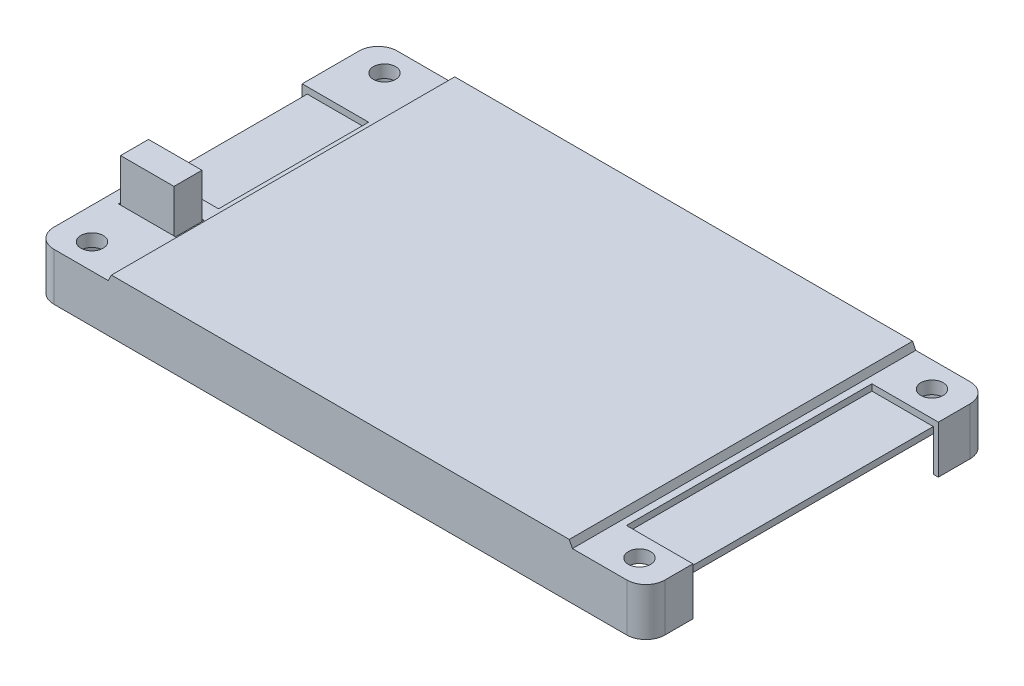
ISO-10303-21;
HEADER;
FILE_DESCRIPTION(('STEP AP214'),'2;1');
FILE_NAME('part.step','',(''),(''),'','','');
FILE_SCHEMA(('AUTOMOTIVE_DESIGN { 1 0 10303 214 1 1 1 1 }'));
ENDSEC;
DATA;
#1=APPLICATION_CONTEXT('core data for automotive mechanical design processes');
#2=APPLICATION_PROTOCOL_DEFINITION('international standard','automotive_design',2000,#1);
#3=PRODUCT_CONTEXT('',#1,'mechanical');
#4=PRODUCT('Part','Part','',(#3));
#5=PRODUCT_RELATED_PRODUCT_CATEGORY('part','',(#4));
#6=PRODUCT_DEFINITION_FORMATION('','',#4);
#7=PRODUCT_DEFINITION_CONTEXT('part definition',#1,'design');
#8=PRODUCT_DEFINITION('design','',#6,#7);
#9=PRODUCT_DEFINITION_SHAPE('','',#8);
#10=(LENGTH_UNIT() NAMED_UNIT(*) SI_UNIT(.MILLI.,.METRE.));
#11=(NAMED_UNIT(*) PLANE_ANGLE_UNIT() SI_UNIT($,.RADIAN.));
#12=(NAMED_UNIT(*) SI_UNIT($,.STERADIAN.) SOLID_ANGLE_UNIT());
#13=UNCERTAINTY_MEASURE_WITH_UNIT(LENGTH_MEASURE(1.E-05),#10,'distance_accuracy_value','');
#14=(GEOMETRIC_REPRESENTATION_CONTEXT(3) GLOBAL_UNCERTAINTY_ASSIGNED_CONTEXT((#13)) GLOBAL_UNIT_ASSIGNED_CONTEXT((#10,
#11,#12)) REPRESENTATION_CONTEXT('',''));
#15=CARTESIAN_POINT('',(0.,0.,0.));
#16=DIRECTION('',(0.,0.,1.));
#17=DIRECTION('',(1.,0.,0.));
#18=AXIS2_PLACEMENT_3D('',#15,#16,#17);
#19=CARTESIAN_POINT('',(43.05,8.5,23.));
#20=DIRECTION('',(0.,-1.,0.));
#21=DIRECTION('',(0.,0.,-1.));
#22=AXIS2_PLACEMENT_3D('',#19,#20,#21);
#23=CYLINDRICAL_SURFACE('',#22,1.75000000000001);
#24=CARTESIAN_POINT('',(43.05,5.5,23.));
#25=DIRECTION('',(0.,-1.,0.));
#26=DIRECTION('',(0.,0.,-1.));
#27=AXIS2_PLACEMENT_3D('',#24,#25,#26);
#28=CIRCLE('',#27,1.75000000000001);
#29=CARTESIAN_POINT('',(43.05,5.5,21.25));
#30=VERTEX_POINT('',#29);
#31=EDGE_CURVE('E11',#30,#30,#28,.T.);
#32=ORIENTED_EDGE('',*,*,#31,.T.);
#33=EDGE_LOOP('',(#32));
#34=FACE_BOUND('',#33,.T.);
#35=CARTESIAN_POINT('',(43.05,7.50000000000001,23.));
#36=DIRECTION('',(0.,-1.,0.));
#37=DIRECTION('',(1.,0.,0.));
#38=AXIS2_PLACEMENT_3D('',#35,#36,#37);
#39=CIRCLE('',#38,1.75);
#40=CARTESIAN_POINT('',(44.8,7.50000000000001,23.));
#41=VERTEX_POINT('',#40);
#42=EDGE_CURVE('E727',#41,#41,#39,.T.);
#43=ORIENTED_EDGE('',*,*,#42,.F.);
#44=EDGE_LOOP('',(#43));
#45=FACE_BOUND('',#44,.T.);
#46=ADVANCED_FACE('F17',(#34,#45),#23,.F.);
#47=CARTESIAN_POINT('',(43.05,8.5,-23.));
#48=DIRECTION('',(0.,-1.,0.));
#49=DIRECTION('',(0.,0.,-1.));
#50=AXIS2_PLACEMENT_3D('',#47,#48,#49);
#51=CYLINDRICAL_SURFACE('',#50,1.75000000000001);
#52=CARTESIAN_POINT('',(43.05,5.5,-23.));
#53=DIRECTION('',(0.,-1.,0.));
#54=DIRECTION('',(0.,0.,-1.));
#55=AXIS2_PLACEMENT_3D('',#52,#53,#54);
#56=CIRCLE('',#55,1.75000000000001);
#57=CARTESIAN_POINT('',(43.05,5.5,-24.75));
#58=VERTEX_POINT('',#57);
#59=EDGE_CURVE('E27',#58,#58,#56,.T.);
#60=ORIENTED_EDGE('',*,*,#59,.T.);
#61=EDGE_LOOP('',(#60));
#62=FACE_BOUND('',#61,.T.);
#63=CARTESIAN_POINT('',(43.05,7.50000000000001,-23.));
#64=DIRECTION('',(0.,-1.,0.));
#65=DIRECTION('',(1.,0.,0.));
#66=AXIS2_PLACEMENT_3D('',#63,#64,#65);
#67=CIRCLE('',#66,1.75);
#68=CARTESIAN_POINT('',(44.8,7.50000000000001,-23.));
#69=VERTEX_POINT('',#68);
#70=EDGE_CURVE('E704',#69,#69,#67,.T.);
#71=ORIENTED_EDGE('',*,*,#70,.F.);
#72=EDGE_LOOP('',(#71));
#73=FACE_BOUND('',#72,.T.);
#74=ADVANCED_FACE('F976',(#62,#73),#51,.F.);
#75=CARTESIAN_POINT('',(-43.05,8.5,23.));
#76=DIRECTION('',(0.,-1.,0.));
#77=DIRECTION('',(0.,0.,-1.));
#78=AXIS2_PLACEMENT_3D('',#75,#76,#77);
#79=CYLINDRICAL_SURFACE('',#78,1.75000000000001);
#80=CARTESIAN_POINT('',(-43.05,5.5,23.));
#81=DIRECTION('',(0.,-1.,0.));
#82=DIRECTION('',(0.,0.,-1.));
#83=AXIS2_PLACEMENT_3D('',#80,#81,#82);
#84=CIRCLE('',#83,1.75000000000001);
#85=CARTESIAN_POINT('',(-43.05,5.5,21.25));
#86=VERTEX_POINT('',#85);
#87=EDGE_CURVE('E1389',#86,#86,#84,.T.);
#88=ORIENTED_EDGE('',*,*,#87,.T.);
#89=EDGE_LOOP('',(#88));
#90=FACE_BOUND('',#89,.T.);
#91=CARTESIAN_POINT('',(-43.05,7.5,23.));
#92=DIRECTION('',(0.,-1.,0.));
#93=DIRECTION('',(1.,0.,0.));
#94=AXIS2_PLACEMENT_3D('',#91,#92,#93);
#95=CIRCLE('',#94,1.75);
#96=CARTESIAN_POINT('',(-41.3,7.5,23.));
#97=VERTEX_POINT('',#96);
#98=EDGE_CURVE('E436',#97,#97,#95,.T.);
#99=ORIENTED_EDGE('',*,*,#98,.F.);
#100=EDGE_LOOP('',(#99));
#101=FACE_BOUND('',#100,.T.);
#102=ADVANCED_FACE('F982',(#90,#101),#79,.F.);
#103=CARTESIAN_POINT('',(-43.05,8.5,-23.));
#104=DIRECTION('',(0.,-1.,0.));
#105=DIRECTION('',(0.,0.,-1.));
#106=AXIS2_PLACEMENT_3D('',#103,#104,#105);
#107=CYLINDRICAL_SURFACE('',#106,1.75000000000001);
#108=CARTESIAN_POINT('',(-43.05,5.5,-23.));
#109=DIRECTION('',(0.,-1.,0.));
#110=DIRECTION('',(0.,0.,-1.));
#111=AXIS2_PLACEMENT_3D('',#108,#109,#110);
#112=CIRCLE('',#111,1.75000000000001);
#113=CARTESIAN_POINT('',(-43.05,5.5,-24.75));
#114=VERTEX_POINT('',#113);
#115=EDGE_CURVE('E1382',#114,#114,#112,.T.);
#116=ORIENTED_EDGE('',*,*,#115,.T.);
#117=EDGE_LOOP('',(#116));
#118=FACE_BOUND('',#117,.T.);
#119=CARTESIAN_POINT('',(-43.05,7.5,-23.));
#120=DIRECTION('',(0.,-1.,0.));
#121=DIRECTION('',(1.,0.,0.));
#122=AXIS2_PLACEMENT_3D('',#119,#120,#121);
#123=CIRCLE('',#122,1.75);
#124=CARTESIAN_POINT('',(-41.3,7.5,-23.));
#125=VERTEX_POINT('',#124);
#126=EDGE_CURVE('E607',#125,#125,#123,.T.);
#127=ORIENTED_EDGE('',*,*,#126,.F.);
#128=EDGE_LOOP('',(#127));
#129=FACE_BOUND('',#128,.T.);
#130=ADVANCED_FACE('F989',(#118,#129),#107,.F.);
#131=CARTESIAN_POINT('',(0.,6.50000000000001,0.));
#132=DIRECTION('',(0.,1.,0.));
#133=DIRECTION('',(0.,0.,1.));
#134=AXIS2_PLACEMENT_3D('',#131,#132,#133);
#135=PLANE('',#134);
#136=DIRECTION('',(0.,0.,1.));
#137=VECTOR('',#136,1.);
#138=CARTESIAN_POINT('',(-46.16,6.50000000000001,11.25));
#139=LINE('',#138,#137);
#140=CARTESIAN_POINT('',(-46.16,6.50000000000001,11.25));
#141=VERTEX_POINT('',#140);
#142=CARTESIAN_POINT('',(-46.16,6.50000000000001,15.75));
#143=VERTEX_POINT('',#142);
#144=EDGE_CURVE('E1380',#141,#143,#139,.T.);
#145=ORIENTED_EDGE('',*,*,#144,.T.);
#146=DIRECTION('',(1.,0.,0.));
#147=VECTOR('',#146,1.);
#148=CARTESIAN_POINT('',(-46.16,6.50000000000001,15.75));
#149=LINE('',#148,#147);
#150=CARTESIAN_POINT('',(-37.16,6.50000000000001,15.75));
#151=VERTEX_POINT('',#150);
#152=EDGE_CURVE('E36',#143,#151,#149,.T.);
#153=ORIENTED_EDGE('',*,*,#152,.T.);
#154=DIRECTION('',(0.,0.,-1.));
#155=VECTOR('',#154,1.);
#156=CARTESIAN_POINT('',(-37.16,6.50000000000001,11.25));
#157=LINE('',#156,#155);
#158=CARTESIAN_POINT('',(-37.16,6.50000000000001,11.25));
#159=VERTEX_POINT('',#158);
#160=EDGE_CURVE('E1376',#151,#159,#157,.T.);
#161=ORIENTED_EDGE('',*,*,#160,.T.);
#162=DIRECTION('',(-1.,0.,0.));
#163=VECTOR('',#162,1.);
#164=CARTESIAN_POINT('',(-46.16,6.50000000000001,11.25));
#165=LINE('',#164,#163);
#166=EDGE_CURVE('E431',#159,#141,#165,.T.);
#167=ORIENTED_EDGE('',*,*,#166,.T.);
#168=EDGE_LOOP('',(#145,#153,#161,#167));
#169=FACE_BOUND('',#168,.T.);
#170=DIRECTION('',(1.,0.,0.));
#171=VECTOR('',#170,1.);
#172=CARTESIAN_POINT('',(-37.46,6.50000000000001,15.7));
#173=LINE('',#172,#171);
#174=CARTESIAN_POINT('',(-45.86,6.50000000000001,15.7));
#175=VERTEX_POINT('',#174);
#176=CARTESIAN_POINT('',(-37.46,6.50000000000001,15.7));
#177=VERTEX_POINT('',#176);
#178=EDGE_CURVE('E406',#175,#177,#173,.T.);
#179=ORIENTED_EDGE('',*,*,#178,.F.);
#180=DIRECTION('',(0.,0.,1.));
#181=VECTOR('',#180,1.);
#182=CARTESIAN_POINT('',(-45.86,6.50000000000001,15.7));
#183=LINE('',#182,#181);
#184=CARTESIAN_POINT('',(-45.86,6.50000000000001,11.3));
#185=VERTEX_POINT('',#184);
#186=EDGE_CURVE('E405',#185,#175,#183,.T.);
#187=ORIENTED_EDGE('',*,*,#186,.F.);
#188=DIRECTION('',(-1.,0.,0.));
#189=VECTOR('',#188,1.);
#190=CARTESIAN_POINT('',(-37.46,6.50000000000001,11.3));
#191=LINE('',#190,#189);
#192=CARTESIAN_POINT('',(-37.46,6.50000000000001,11.3));
#193=VERTEX_POINT('',#192);
#194=EDGE_CURVE('E395',#193,#185,#191,.T.);
#195=ORIENTED_EDGE('',*,*,#194,.F.);
#196=DIRECTION('',(0.,0.,-1.));
#197=VECTOR('',#196,1.);
#198=CARTESIAN_POINT('',(-37.46,6.50000000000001,15.7));
#199=LINE('',#198,#197);
#200=EDGE_CURVE('E393',#177,#193,#199,.T.);
#201=ORIENTED_EDGE('',*,*,#200,.F.);
#202=EDGE_LOOP('',(#179,#187,#195,#201));
#203=FACE_BOUND('',#202,.T.);
#204=ADVANCED_FACE('F424',(#169,#203),#135,.T.);
#205=CARTESIAN_POINT('',(-37.6,8.5,-15.05));
#206=DIRECTION('',(1.,0.,0.));
#207=DIRECTION('',(0.,0.,-1.));
#208=AXIS2_PLACEMENT_3D('',#205,#206,#207);
#209=PLANE('',#208);
#210=DIRECTION('',(0.,0.,1.));
#211=VECTOR('',#210,1.);
#212=CARTESIAN_POINT('',(-37.6,6.5,-15.05));
#213=LINE('',#212,#211);
#214=CARTESIAN_POINT('',(-37.6,6.5,-15.05));
#215=VERTEX_POINT('',#214);
#216=CARTESIAN_POINT('',(-37.6,6.5,8.55000000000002));
#217=VERTEX_POINT('',#216);
#218=EDGE_CURVE('E428',#215,#217,#213,.T.);
#219=ORIENTED_EDGE('',*,*,#218,.T.);
#220=DIRECTION('',(0.,-1.,0.));
#221=VECTOR('',#220,1.);
#222=CARTESIAN_POINT('',(-37.6,8.5,8.55000000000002));
#223=LINE('',#222,#221);
#224=CARTESIAN_POINT('',(-37.6,7.5,8.55000000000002));
#225=VERTEX_POINT('',#224);
#226=EDGE_CURVE('E433',#225,#217,#223,.T.);
#227=ORIENTED_EDGE('',*,*,#226,.F.);
#228=DIRECTION('',(0.,0.,-1.));
#229=VECTOR('',#228,1.);
#230=CARTESIAN_POINT('',(-37.6,7.5,-15.05));
#231=LINE('',#230,#229);
#232=CARTESIAN_POINT('',(-37.6,7.5,-15.05));
#233=VERTEX_POINT('',#232);
#234=EDGE_CURVE('E432',#225,#233,#231,.T.);
#235=ORIENTED_EDGE('',*,*,#234,.T.);
#236=DIRECTION('',(0.,-1.,0.));
#237=VECTOR('',#236,1.);
#238=CARTESIAN_POINT('',(-37.6,8.5,-15.05));
#239=LINE('',#238,#237);
#240=EDGE_CURVE('E439',#233,#215,#239,.T.);
#241=ORIENTED_EDGE('',*,*,#240,.T.);
#242=EDGE_LOOP('',(#219,#227,#235,#241));
#243=FACE_BOUND('',#242,.T.);
#244=ADVANCED_FACE('F996',(#243),#209,.F.);
#245=CARTESIAN_POINT('',(-48.05,0.,-15.05));
#246=DIRECTION('',(0.,-1.,0.));
#247=DIRECTION('',(0.,0.,-1.));
#248=AXIS2_PLACEMENT_3D('',#245,#246,#247);
#249=PLANE('',#248);
#250=DIRECTION('',(0.,0.,-1.));
#251=VECTOR('',#250,1.);
#252=CARTESIAN_POINT('',(-47.25,0.,24.));
#253=LINE('',#252,#251);
#254=CARTESIAN_POINT('',(-47.25,0.,-15.05));
#255=VERTEX_POINT('',#254);
#256=CARTESIAN_POINT('',(-47.25,0.,-24.));
#257=VERTEX_POINT('',#256);
#258=EDGE_CURVE('E442',#255,#257,#253,.T.);
#259=ORIENTED_EDGE('',*,*,#258,.F.);
#260=DIRECTION('',(1.,0.,0.));
#261=VECTOR('',#260,1.);
#262=CARTESIAN_POINT('',(-48.05,0.,-15.05));
#263=LINE('',#262,#261);
#264=CARTESIAN_POINT('',(-48.05,0.,-15.05));
#265=VERTEX_POINT('',#264);
#266=EDGE_CURVE('E447',#265,#255,#263,.T.);
#267=ORIENTED_EDGE('',*,*,#266,.F.);
#268=DIRECTION('',(0.,0.,1.));
#269=VECTOR('',#268,1.);
#270=CARTESIAN_POINT('',(-48.05,0.,-15.05));
#271=LINE('',#270,#269);
#272=CARTESIAN_POINT('',(-48.05,0.,-24.));
#273=VERTEX_POINT('',#272);
#274=EDGE_CURVE('E452',#273,#265,#271,.T.);
#275=ORIENTED_EDGE('',*,*,#274,.F.);
#276=CARTESIAN_POINT('',(-45.05,0.,-24.));
#277=DIRECTION('',(0.,-1.,0.));
#278=DIRECTION('',(0.,0.,-1.));
#279=AXIS2_PLACEMENT_3D('',#276,#277,#278);
#280=CIRCLE('',#279,3.);
#281=CARTESIAN_POINT('',(-45.05,0.,-27.));
#282=VERTEX_POINT('',#281);
#283=EDGE_CURVE('E441',#273,#282,#280,.T.);
#284=ORIENTED_EDGE('',*,*,#283,.T.);
#285=DIRECTION('',(-1.,0.,0.));
#286=VECTOR('',#285,1.);
#287=CARTESIAN_POINT('',(48.05,0.,-27.));
#288=LINE('',#287,#286);
#289=CARTESIAN_POINT('',(45.05,0.,-27.));
#290=VERTEX_POINT('',#289);
#291=EDGE_CURVE('E460',#290,#282,#288,.T.);
#292=ORIENTED_EDGE('',*,*,#291,.F.);
#293=CARTESIAN_POINT('',(45.05,0.,-24.));
#294=DIRECTION('',(0.,-1.,0.));
#295=DIRECTION('',(0.,0.,-1.));
#296=AXIS2_PLACEMENT_3D('',#293,#294,#295);
#297=CIRCLE('',#296,3.);
#298=CARTESIAN_POINT('',(48.05,0.,-24.));
#299=VERTEX_POINT('',#298);
#300=EDGE_CURVE('E459',#290,#299,#297,.T.);
#301=ORIENTED_EDGE('',*,*,#300,.T.);
#302=DIRECTION('',(0.,0.,-1.));
#303=VECTOR('',#302,1.);
#304=CARTESIAN_POINT('',(48.05,0.,-19.));
#305=LINE('',#304,#303);
#306=CARTESIAN_POINT('',(48.05,0.,-19.));
#307=VERTEX_POINT('',#306);
#308=EDGE_CURVE('E467',#307,#299,#305,.T.);
#309=ORIENTED_EDGE('',*,*,#308,.F.);
#310=DIRECTION('',(1.,0.,0.));
#311=VECTOR('',#310,1.);
#312=CARTESIAN_POINT('',(37.6,0.,-19.));
#313=LINE('',#312,#311);
#314=CARTESIAN_POINT('',(47.25,0.,-19.));
#315=VERTEX_POINT('',#314);
#316=EDGE_CURVE('E471',#315,#307,#313,.T.);
#317=ORIENTED_EDGE('',*,*,#316,.F.);
#318=DIRECTION('',(0.,0.,1.));
#319=VECTOR('',#318,1.);
#320=CARTESIAN_POINT('',(47.25,0.,24.));
#321=LINE('',#320,#319);
#322=CARTESIAN_POINT('',(47.25,0.,-24.));
#323=VERTEX_POINT('',#322);
#324=EDGE_CURVE('E445',#323,#315,#321,.T.);
#325=ORIENTED_EDGE('',*,*,#324,.F.);
#326=CARTESIAN_POINT('',(45.05,0.,-24.));
#327=DIRECTION('',(0.,-1.,0.));
#328=DIRECTION('',(0.,0.,-1.));
#329=AXIS2_PLACEMENT_3D('',#326,#327,#328);
#330=CIRCLE('',#329,2.2);
#331=CARTESIAN_POINT('',(45.05,0.,-26.2));
#332=VERTEX_POINT('',#331);
#333=EDGE_CURVE('E478',#332,#323,#330,.T.);
#334=ORIENTED_EDGE('',*,*,#333,.F.);
#335=DIRECTION('',(1.,0.,0.));
#336=VECTOR('',#335,1.);
#337=CARTESIAN_POINT('',(-45.05,0.,-26.2));
#338=LINE('',#337,#336);
#339=CARTESIAN_POINT('',(30.05,0.,-26.2));
#340=VERTEX_POINT('',#339);
#341=EDGE_CURVE('E482',#340,#332,#338,.T.);
#342=ORIENTED_EDGE('',*,*,#341,.F.);
#343=DIRECTION('',(0.,0.,1.));
#344=VECTOR('',#343,1.);
#345=CARTESIAN_POINT('',(30.05,0.,-26.2));
#346=LINE('',#345,#344);
#347=CARTESIAN_POINT('',(30.05,0.,-25.4));
#348=VERTEX_POINT('',#347);
#349=EDGE_CURVE('E466',#340,#348,#346,.T.);
#350=ORIENTED_EDGE('',*,*,#349,.T.);
#351=DIRECTION('',(-1.,0.,0.));
#352=VECTOR('',#351,1.);
#353=CARTESIAN_POINT('',(30.05,0.,-25.4));
#354=LINE('',#353,#352);
#355=CARTESIAN_POINT('',(24.95,0.,-25.4));
#356=VERTEX_POINT('',#355);
#357=EDGE_CURVE('E488',#348,#356,#354,.T.);
#358=ORIENTED_EDGE('',*,*,#357,.T.);
#359=DIRECTION('',(0.,0.,-1.));
#360=VECTOR('',#359,1.);
#361=CARTESIAN_POINT('',(24.95,0.,-26.2));
#362=LINE('',#361,#360);
#363=CARTESIAN_POINT('',(24.95,0.,-26.2));
#364=VERTEX_POINT('',#363);
#365=EDGE_CURVE('E491',#356,#364,#362,.T.);
#366=ORIENTED_EDGE('',*,*,#365,.T.);
#367=DIRECTION('',(1.,0.,0.));
#368=VECTOR('',#367,1.);
#369=CARTESIAN_POINT('',(-45.05,0.,-26.2));
#370=LINE('',#369,#368);
#371=CARTESIAN_POINT('',(-24.95,0.,-26.2));
#372=VERTEX_POINT('',#371);
#373=EDGE_CURVE('E495',#372,#364,#370,.T.);
#374=ORIENTED_EDGE('',*,*,#373,.F.);
#375=DIRECTION('',(0.,0.,1.));
#376=VECTOR('',#375,1.);
#377=CARTESIAN_POINT('',(-24.95,0.,-26.2));
#378=LINE('',#377,#376);
#379=CARTESIAN_POINT('',(-24.95,0.,-25.4));
#380=VERTEX_POINT('',#379);
#381=EDGE_CURVE('E494',#372,#380,#378,.T.);
#382=ORIENTED_EDGE('',*,*,#381,.T.);
#383=DIRECTION('',(-1.,0.,0.));
#384=VECTOR('',#383,1.);
#385=CARTESIAN_POINT('',(-30.05,0.,-25.4));
#386=LINE('',#385,#384);
#387=CARTESIAN_POINT('',(-30.05,0.,-25.4));
#388=VERTEX_POINT('',#387);
#389=EDGE_CURVE('E501',#380,#388,#386,.T.);
#390=ORIENTED_EDGE('',*,*,#389,.T.);
#391=DIRECTION('',(0.,0.,-1.));
#392=VECTOR('',#391,1.);
#393=CARTESIAN_POINT('',(-30.05,0.,-26.2));
#394=LINE('',#393,#392);
#395=CARTESIAN_POINT('',(-30.05,0.,-26.2));
#396=VERTEX_POINT('',#395);
#397=EDGE_CURVE('E504',#388,#396,#394,.T.);
#398=ORIENTED_EDGE('',*,*,#397,.T.);
#399=DIRECTION('',(1.,0.,0.));
#400=VECTOR('',#399,1.);
#401=CARTESIAN_POINT('',(-45.05,0.,-26.2));
#402=LINE('',#401,#400);
#403=CARTESIAN_POINT('',(-45.05,0.,-26.2));
#404=VERTEX_POINT('',#403);
#405=EDGE_CURVE('E508',#404,#396,#402,.T.);
#406=ORIENTED_EDGE('',*,*,#405,.F.);
#407=CARTESIAN_POINT('',(-45.05,0.,-24.));
#408=DIRECTION('',(0.,-1.,0.));
#409=DIRECTION('',(0.,0.,-1.));
#410=AXIS2_PLACEMENT_3D('',#407,#408,#409);
#411=CIRCLE('',#410,2.2);
#412=EDGE_CURVE('E498',#257,#404,#411,.T.);
#413=ORIENTED_EDGE('',*,*,#412,.F.);
#414=EDGE_LOOP('',(#259,#267,#275,#284,#292,#301,#309,#317,#325,#334,#342,#350,#358,#366,#374,
#382,#390,#398,#406,#413));
#415=FACE_BOUND('',#414,.T.);
#416=ADVANCED_FACE('F1000',(#415),#249,.T.);
#417=CARTESIAN_POINT('',(37.6,8.5,19.6));
#418=DIRECTION('',(-1.,0.,0.));
#419=DIRECTION('',(0.,0.,1.));
#420=AXIS2_PLACEMENT_3D('',#417,#418,#419);
#421=PLANE('',#420);
#422=DIRECTION('',(0.,-1.,0.));
#423=VECTOR('',#422,1.);
#424=CARTESIAN_POINT('',(37.6,8.5,19.6));
#425=LINE('',#424,#423);
#426=CARTESIAN_POINT('',(37.6,7.50000000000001,19.6));
#427=VERTEX_POINT('',#426);
#428=CARTESIAN_POINT('',(37.6,6.5,19.6));
#429=VERTEX_POINT('',#428);
#430=EDGE_CURVE('E507',#427,#429,#425,.T.);
#431=ORIENTED_EDGE('',*,*,#430,.T.);
#432=DIRECTION('',(0.,0.,-1.));
#433=VECTOR('',#432,1.);
#434=CARTESIAN_POINT('',(37.6,6.5,-19.));
#435=LINE('',#434,#433);
#436=CARTESIAN_POINT('',(37.6,6.5,-19.));
#437=VERTEX_POINT('',#436);
#438=EDGE_CURVE('E515',#429,#437,#435,.T.);
#439=ORIENTED_EDGE('',*,*,#438,.T.);
#440=DIRECTION('',(0.,-1.,0.));
#441=VECTOR('',#440,1.);
#442=CARTESIAN_POINT('',(37.6,8.5,-19.));
#443=LINE('',#442,#441);
#444=CARTESIAN_POINT('',(37.6,7.50000000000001,-19.));
#445=VERTEX_POINT('',#444);
#446=EDGE_CURVE('E519',#445,#437,#443,.T.);
#447=ORIENTED_EDGE('',*,*,#446,.F.);
#448=DIRECTION('',(0.,0.,1.));
#449=VECTOR('',#448,1.);
#450=CARTESIAN_POINT('',(37.6,7.50000000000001,19.6));
#451=LINE('',#450,#449);
#452=EDGE_CURVE('E518',#445,#427,#451,.T.);
#453=ORIENTED_EDGE('',*,*,#452,.T.);
#454=EDGE_LOOP('',(#431,#439,#447,#453));
#455=FACE_BOUND('',#454,.T.);
#456=ADVANCED_FACE('F906',(#455),#421,.F.);
#457=CARTESIAN_POINT('',(-48.05,8.5,-15.05));
#458=DIRECTION('',(0.,-1.,0.));
#459=DIRECTION('',(0.,0.,-1.));
#460=AXIS2_PLACEMENT_3D('',#457,#458,#459);
#461=PLANE('',#460);
#462=DIRECTION('',(1.,0.,0.));
#463=VECTOR('',#462,1.);
#464=CARTESIAN_POINT('',(-48.05,8.5,27.));
#465=LINE('',#464,#463);
#466=CARTESIAN_POINT('',(-36.,8.5,27.));
#467=VERTEX_POINT('',#466);
#468=CARTESIAN_POINT('',(36.,8.5,27.));
#469=VERTEX_POINT('',#468);
#470=EDGE_CURVE('E523',#467,#469,#465,.T.);
#471=ORIENTED_EDGE('',*,*,#470,.T.);
#472=DIRECTION('',(0.,0.,1.));
#473=VECTOR('',#472,1.);
#474=CARTESIAN_POINT('',(36.,8.5,-27.));
#475=LINE('',#474,#473);
#476=CARTESIAN_POINT('',(36.,8.5,-27.));
#477=VERTEX_POINT('',#476);
#478=EDGE_CURVE('E527',#477,#469,#475,.T.);
#479=ORIENTED_EDGE('',*,*,#478,.F.);
#480=DIRECTION('',(-1.,0.,0.));
#481=VECTOR('',#480,1.);
#482=CARTESIAN_POINT('',(48.05,8.5,-27.));
#483=LINE('',#482,#481);
#484=CARTESIAN_POINT('',(-36.,8.5,-27.));
#485=VERTEX_POINT('',#484);
#486=EDGE_CURVE('E526',#477,#485,#483,.T.);
#487=ORIENTED_EDGE('',*,*,#486,.T.);
#488=DIRECTION('',(0.,0.,1.));
#489=VECTOR('',#488,1.);
#490=CARTESIAN_POINT('',(-36.,8.5,-27.));
#491=LINE('',#490,#489);
#492=EDGE_CURVE('E533',#485,#467,#491,.T.);
#493=ORIENTED_EDGE('',*,*,#492,.T.);
#494=EDGE_LOOP('',(#471,#479,#487,#493));
#495=FACE_BOUND('',#494,.T.);
#496=ADVANCED_FACE('F1007',(#495),#461,.F.);
#497=CARTESIAN_POINT('',(-48.05,0.,-15.05));
#498=DIRECTION('',(0.,-1.,0.));
#499=DIRECTION('',(0.,0.,-1.));
#500=AXIS2_PLACEMENT_3D('',#497,#498,#499);
#501=PLANE('',#500);
#502=DIRECTION('',(0.,0.,-1.));
#503=VECTOR('',#502,1.);
#504=CARTESIAN_POINT('',(-47.25,0.,24.));
#505=LINE('',#504,#503);
#506=CARTESIAN_POINT('',(-47.25,0.,24.));
#507=VERTEX_POINT('',#506);
#508=CARTESIAN_POINT('',(-47.25,0.,8.55000000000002));
#509=VERTEX_POINT('',#508);
#510=EDGE_CURVE('E536',#507,#509,#505,.T.);
#511=ORIENTED_EDGE('',*,*,#510,.F.);
#512=CARTESIAN_POINT('',(-45.05,0.,24.));
#513=DIRECTION('',(0.,-1.,0.));
#514=DIRECTION('',(0.,0.,-1.));
#515=AXIS2_PLACEMENT_3D('',#512,#513,#514);
#516=CIRCLE('',#515,2.2);
#517=CARTESIAN_POINT('',(-45.05,0.,26.2));
#518=VERTEX_POINT('',#517);
#519=EDGE_CURVE('E539',#518,#507,#516,.T.);
#520=ORIENTED_EDGE('',*,*,#519,.F.);
#521=DIRECTION('',(-1.,0.,0.));
#522=VECTOR('',#521,1.);
#523=CARTESIAN_POINT('',(-45.05,0.,26.2));
#524=LINE('',#523,#522);
#525=CARTESIAN_POINT('',(-30.05,0.,26.2));
#526=VERTEX_POINT('',#525);
#527=EDGE_CURVE('E542',#526,#518,#524,.T.);
#528=ORIENTED_EDGE('',*,*,#527,.F.);
#529=DIRECTION('',(0.,0.,-1.));
#530=VECTOR('',#529,1.);
#531=CARTESIAN_POINT('',(-30.05,0.,26.2));
#532=LINE('',#531,#530);
#533=CARTESIAN_POINT('',(-30.05,0.,25.4));
#534=VERTEX_POINT('',#533);
#535=EDGE_CURVE('E535',#526,#534,#532,.T.);
#536=ORIENTED_EDGE('',*,*,#535,.T.);
#537=DIRECTION('',(1.,0.,0.));
#538=VECTOR('',#537,1.);
#539=CARTESIAN_POINT('',(-30.05,0.,25.4));
#540=LINE('',#539,#538);
#541=CARTESIAN_POINT('',(-24.95,0.,25.4));
#542=VERTEX_POINT('',#541);
#543=EDGE_CURVE('E548',#534,#542,#540,.T.);
#544=ORIENTED_EDGE('',*,*,#543,.T.);
#545=DIRECTION('',(0.,0.,1.));
#546=VECTOR('',#545,1.);
#547=CARTESIAN_POINT('',(-24.95,0.,26.2));
#548=LINE('',#547,#546);
#549=CARTESIAN_POINT('',(-24.95,0.,26.2));
#550=VERTEX_POINT('',#549);
#551=EDGE_CURVE('E551',#542,#550,#548,.T.);
#552=ORIENTED_EDGE('',*,*,#551,.T.);
#553=DIRECTION('',(-1.,0.,0.));
#554=VECTOR('',#553,1.);
#555=CARTESIAN_POINT('',(-45.05,0.,26.2));
#556=LINE('',#555,#554);
#557=CARTESIAN_POINT('',(24.95,0.,26.2));
#558=VERTEX_POINT('',#557);
#559=EDGE_CURVE('E555',#558,#550,#556,.T.);
#560=ORIENTED_EDGE('',*,*,#559,.F.);
#561=DIRECTION('',(0.,0.,-1.));
#562=VECTOR('',#561,1.);
#563=CARTESIAN_POINT('',(24.95,0.,26.2));
#564=LINE('',#563,#562);
#565=CARTESIAN_POINT('',(24.95,0.,25.4));
#566=VERTEX_POINT('',#565);
#567=EDGE_CURVE('E554',#558,#566,#564,.T.);
#568=ORIENTED_EDGE('',*,*,#567,.T.);
#569=DIRECTION('',(1.,0.,0.));
#570=VECTOR('',#569,1.);
#571=CARTESIAN_POINT('',(30.05,0.,25.4));
#572=LINE('',#571,#570);
#573=CARTESIAN_POINT('',(30.05,0.,25.4));
#574=VERTEX_POINT('',#573);
#575=EDGE_CURVE('E561',#566,#574,#572,.T.);
#576=ORIENTED_EDGE('',*,*,#575,.T.);
#577=DIRECTION('',(0.,0.,1.));
#578=VECTOR('',#577,1.);
#579=CARTESIAN_POINT('',(30.05,0.,26.2));
#580=LINE('',#579,#578);
#581=CARTESIAN_POINT('',(30.05,0.,26.2));
#582=VERTEX_POINT('',#581);
#583=EDGE_CURVE('E564',#574,#582,#580,.T.);
#584=ORIENTED_EDGE('',*,*,#583,.T.);
#585=DIRECTION('',(-1.,0.,0.));
#586=VECTOR('',#585,1.);
#587=CARTESIAN_POINT('',(-45.05,0.,26.2));
#588=LINE('',#587,#586);
#589=CARTESIAN_POINT('',(45.05,0.,26.2));
#590=VERTEX_POINT('',#589);
#591=EDGE_CURVE('E568',#590,#582,#588,.T.);
#592=ORIENTED_EDGE('',*,*,#591,.F.);
#593=CARTESIAN_POINT('',(45.05,0.,24.));
#594=DIRECTION('',(0.,-1.,0.));
#595=DIRECTION('',(0.,0.,-1.));
#596=AXIS2_PLACEMENT_3D('',#593,#594,#595);
#597=CIRCLE('',#596,2.2);
#598=CARTESIAN_POINT('',(47.25,0.,24.));
#599=VERTEX_POINT('',#598);
#600=EDGE_CURVE('E571',#599,#590,#597,.T.);
#601=ORIENTED_EDGE('',*,*,#600,.F.);
#602=DIRECTION('',(0.,0.,1.));
#603=VECTOR('',#602,1.);
#604=CARTESIAN_POINT('',(47.25,0.,24.));
#605=LINE('',#604,#603);
#606=CARTESIAN_POINT('',(47.25,0.,19.6));
#607=VERTEX_POINT('',#606);
#608=EDGE_CURVE('E530',#607,#599,#605,.T.);
#609=ORIENTED_EDGE('',*,*,#608,.F.);
#610=DIRECTION('',(-1.,0.,0.));
#611=VECTOR('',#610,1.);
#612=CARTESIAN_POINT('',(48.05,0.,19.6));
#613=LINE('',#612,#611);
#614=CARTESIAN_POINT('',(48.05,0.,19.6));
#615=VERTEX_POINT('',#614);
#616=EDGE_CURVE('E576',#615,#607,#613,.T.);
#617=ORIENTED_EDGE('',*,*,#616,.F.);
#618=DIRECTION('',(0.,0.,-1.));
#619=VECTOR('',#618,1.);
#620=CARTESIAN_POINT('',(48.05,0.,27.));
#621=LINE('',#620,#619);
#622=CARTESIAN_POINT('',(48.05,0.,24.));
#623=VERTEX_POINT('',#622);
#624=EDGE_CURVE('E581',#623,#615,#621,.T.);
#625=ORIENTED_EDGE('',*,*,#624,.F.);
#626=CARTESIAN_POINT('',(45.05,0.,24.));
#627=DIRECTION('',(0.,-1.,0.));
#628=DIRECTION('',(0.,0.,-1.));
#629=AXIS2_PLACEMENT_3D('',#626,#627,#628);
#630=CIRCLE('',#629,3.);
#631=CARTESIAN_POINT('',(45.05,0.,27.));
#632=VERTEX_POINT('',#631);
#633=EDGE_CURVE('E567',#623,#632,#630,.T.);
#634=ORIENTED_EDGE('',*,*,#633,.T.);
#635=DIRECTION('',(1.,0.,0.));
#636=VECTOR('',#635,1.);
#637=CARTESIAN_POINT('',(-48.05,0.,27.));
#638=LINE('',#637,#636);
#639=CARTESIAN_POINT('',(-45.05,0.,27.));
#640=VERTEX_POINT('',#639);
#641=EDGE_CURVE('E589',#640,#632,#638,.T.);
#642=ORIENTED_EDGE('',*,*,#641,.F.);
#643=CARTESIAN_POINT('',(-45.05,0.,24.));
#644=DIRECTION('',(0.,-1.,0.));
#645=DIRECTION('',(0.,0.,-1.));
#646=AXIS2_PLACEMENT_3D('',#643,#644,#645);
#647=CIRCLE('',#646,3.);
#648=CARTESIAN_POINT('',(-48.05,0.,24.));
#649=VERTEX_POINT('',#648);
#650=EDGE_CURVE('E588',#640,#649,#647,.T.);
#651=ORIENTED_EDGE('',*,*,#650,.T.);
#652=DIRECTION('',(0.,0.,1.));
#653=VECTOR('',#652,1.);
#654=CARTESIAN_POINT('',(-48.05,0.,27.));
#655=LINE('',#654,#653);
#656=CARTESIAN_POINT('',(-48.05,0.,8.55000000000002));
#657=VERTEX_POINT('',#656);
#658=EDGE_CURVE('E596',#657,#649,#655,.T.);
#659=ORIENTED_EDGE('',*,*,#658,.F.);
#660=DIRECTION('',(-1.,0.,0.));
#661=VECTOR('',#660,1.);
#662=CARTESIAN_POINT('',(-37.6,0.,8.55000000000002));
#663=LINE('',#662,#661);
#664=EDGE_CURVE('E600',#509,#657,#663,.T.);
#665=ORIENTED_EDGE('',*,*,#664,.F.);
#666=EDGE_LOOP('',(#511,#520,#528,#536,#544,#552,#560,#568,#576,#584,#592,#601,#609,#617,#625,
#634,#642,#651,#659,#665));
#667=FACE_BOUND('',#666,.T.);
#668=ADVANCED_FACE('F915',(#667),#501,.T.);
#669=CARTESIAN_POINT('',(-48.05,8.5,27.));
#670=DIRECTION('',(1.,0.,0.));
#671=DIRECTION('',(0.,0.,-1.));
#672=AXIS2_PLACEMENT_3D('',#669,#670,#671);
#673=PLANE('',#672);
#674=DIRECTION('',(0.,1.,0.));
#675=VECTOR('',#674,1.);
#676=CARTESIAN_POINT('',(-48.05,8.5,24.));
#677=LINE('',#676,#675);
#678=CARTESIAN_POINT('',(-48.05,7.5,24.));
#679=VERTEX_POINT('',#678);
#680=EDGE_CURVE('E595',#649,#679,#677,.T.);
#681=ORIENTED_EDGE('',*,*,#680,.T.);
#682=DIRECTION('',(0.,0.,1.));
#683=VECTOR('',#682,1.);
#684=CARTESIAN_POINT('',(-48.05,7.5,-27.));
#685=LINE('',#684,#683);
#686=CARTESIAN_POINT('',(-48.05,7.5,8.55000000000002));
#687=VERTEX_POINT('',#686);
#688=EDGE_CURVE('E605',#687,#679,#685,.T.);
#689=ORIENTED_EDGE('',*,*,#688,.F.);
#690=DIRECTION('',(0.,-1.,0.));
#691=VECTOR('',#690,1.);
#692=CARTESIAN_POINT('',(-48.05,8.5,8.55000000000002));
#693=LINE('',#692,#691);
#694=EDGE_CURVE('E598',#687,#657,#693,.T.);
#695=ORIENTED_EDGE('',*,*,#694,.T.);
#696=ORIENTED_EDGE('',*,*,#658,.T.);
#697=EDGE_LOOP('',(#681,#689,#695,#696));
#698=FACE_BOUND('',#697,.T.);
#699=ADVANCED_FACE('F932',(#698),#673,.F.);
#700=CARTESIAN_POINT('',(-48.05,8.5,27.));
#701=DIRECTION('',(0.,0.,-1.));
#702=DIRECTION('',(-1.,0.,0.));
#703=AXIS2_PLACEMENT_3D('',#700,#701,#702);
#704=PLANE('',#703);
#705=DIRECTION('',(0.,1.,0.));
#706=VECTOR('',#705,1.);
#707=CARTESIAN_POINT('',(45.05,8.5,27.));
#708=LINE('',#707,#706);
#709=CARTESIAN_POINT('',(45.05,7.50000000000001,27.));
#710=VERTEX_POINT('',#709);
#711=EDGE_CURVE('E599',#632,#710,#708,.T.);
#712=ORIENTED_EDGE('',*,*,#711,.T.);
#713=DIRECTION('',(1.,0.,0.));
#714=VECTOR('',#713,1.);
#715=CARTESIAN_POINT('',(36.5,7.50000000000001,27.));
#716=LINE('',#715,#714);
#717=CARTESIAN_POINT('',(36.5,7.50000000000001,27.));
#718=VERTEX_POINT('',#717);
#719=EDGE_CURVE('E613',#718,#710,#716,.T.);
#720=ORIENTED_EDGE('',*,*,#719,.F.);
#721=DIRECTION('',(0.447213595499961,-0.894427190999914,0.));
#722=VECTOR('',#721,1.);
#723=CARTESIAN_POINT('',(36.,8.5,27.));
#724=LINE('',#723,#722);
#725=EDGE_CURVE('E529',#469,#718,#724,.T.);
#726=ORIENTED_EDGE('',*,*,#725,.F.);
#727=ORIENTED_EDGE('',*,*,#470,.F.);
#728=DIRECTION('',(0.447213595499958,0.894427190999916,0.));
#729=VECTOR('',#728,1.);
#730=CARTESIAN_POINT('',(-36.5,7.5,27.));
#731=LINE('',#730,#729);
#732=CARTESIAN_POINT('',(-36.5,7.5,27.));
#733=VERTEX_POINT('',#732);
#734=EDGE_CURVE('E618',#733,#467,#731,.T.);
#735=ORIENTED_EDGE('',*,*,#734,.F.);
#736=DIRECTION('',(1.,0.,0.));
#737=VECTOR('',#736,1.);
#738=CARTESIAN_POINT('',(-36.5,7.5,27.));
#739=LINE('',#738,#737);
#740=CARTESIAN_POINT('',(-45.05,7.5,27.));
#741=VERTEX_POINT('',#740);
#742=EDGE_CURVE('E623',#741,#733,#739,.T.);
#743=ORIENTED_EDGE('',*,*,#742,.F.);
#744=DIRECTION('',(0.,-1.,0.));
#745=VECTOR('',#744,1.);
#746=CARTESIAN_POINT('',(-45.05,8.5,27.));
#747=LINE('',#746,#745);
#748=EDGE_CURVE('E591',#741,#640,#747,.T.);
#749=ORIENTED_EDGE('',*,*,#748,.T.);
#750=ORIENTED_EDGE('',*,*,#641,.T.);
#751=EDGE_LOOP('',(#712,#720,#726,#727,#735,#743,#749,#750));
#752=FACE_BOUND('',#751,.T.);
#753=ADVANCED_FACE('F922',(#752),#704,.F.);
#754=CARTESIAN_POINT('',(48.05,8.5,27.));
#755=DIRECTION('',(-1.,0.,0.));
#756=DIRECTION('',(0.,0.,1.));
#757=AXIS2_PLACEMENT_3D('',#754,#755,#756);
#758=PLANE('',#757);
#759=DIRECTION('',(0.,-1.,0.));
#760=VECTOR('',#759,1.);
#761=CARTESIAN_POINT('',(48.05,8.5,19.6));
#762=LINE('',#761,#760);
#763=CARTESIAN_POINT('',(48.05,7.50000000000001,19.6));
#764=VERTEX_POINT('',#763);
#765=EDGE_CURVE('E579',#764,#615,#762,.T.);
#766=ORIENTED_EDGE('',*,*,#765,.F.);
#767=DIRECTION('',(0.,0.,1.));
#768=VECTOR('',#767,1.);
#769=CARTESIAN_POINT('',(48.05,7.50000000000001,-27.));
#770=LINE('',#769,#768);
#771=CARTESIAN_POINT('',(48.05,7.50000000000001,24.));
#772=VERTEX_POINT('',#771);
#773=EDGE_CURVE('E592',#764,#772,#770,.T.);
#774=ORIENTED_EDGE('',*,*,#773,.T.);
#775=DIRECTION('',(0.,-1.,0.));
#776=VECTOR('',#775,1.);
#777=CARTESIAN_POINT('',(48.05,8.5,24.));
#778=LINE('',#777,#776);
#779=EDGE_CURVE('E584',#772,#623,#778,.T.);
#780=ORIENTED_EDGE('',*,*,#779,.T.);
#781=ORIENTED_EDGE('',*,*,#624,.T.);
#782=EDGE_LOOP('',(#766,#774,#780,#781));
#783=FACE_BOUND('',#782,.T.);
#784=ADVANCED_FACE('F911',(#783),#758,.F.);
#785=CARTESIAN_POINT('',(48.05,8.5,19.6));
#786=DIRECTION('',(0.,0.,1.));
#787=DIRECTION('',(1.,0.,0.));
#788=AXIS2_PLACEMENT_3D('',#785,#786,#787);
#789=PLANE('',#788);
#790=DIRECTION('',(0.,1.,0.));
#791=VECTOR('',#790,1.);
#792=CARTESIAN_POINT('',(47.25,8.5,19.6));
#793=LINE('',#792,#791);
#794=CARTESIAN_POINT('',(47.25,5.5,19.6));
#795=VERTEX_POINT('',#794);
#796=EDGE_CURVE('E585',#607,#795,#793,.T.);
#797=ORIENTED_EDGE('',*,*,#796,.T.);
#798=DIRECTION('',(0.,-1.,0.));
#799=VECTOR('',#798,1.);
#800=CARTESIAN_POINT('',(47.25,6.5,19.6));
#801=LINE('',#800,#799);
#802=CARTESIAN_POINT('',(47.25,6.5,19.6));
#803=VERTEX_POINT('',#802);
#804=EDGE_CURVE('E408',#803,#795,#801,.T.);
#805=ORIENTED_EDGE('',*,*,#804,.F.);
#806=DIRECTION('',(-1.,0.,0.));
#807=VECTOR('',#806,1.);
#808=CARTESIAN_POINT('',(37.6,6.5,19.6));
#809=LINE('',#808,#807);
#810=EDGE_CURVE('E638',#803,#429,#809,.T.);
#811=ORIENTED_EDGE('',*,*,#810,.T.);
#812=ORIENTED_EDGE('',*,*,#430,.F.);
#813=DIRECTION('',(1.,0.,0.));
#814=VECTOR('',#813,1.);
#815=CARTESIAN_POINT('',(48.05,7.50000000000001,19.6));
#816=LINE('',#815,#814);
#817=EDGE_CURVE('E631',#427,#764,#816,.T.);
#818=ORIENTED_EDGE('',*,*,#817,.T.);
#819=ORIENTED_EDGE('',*,*,#765,.T.);
#820=ORIENTED_EDGE('',*,*,#616,.T.);
#821=EDGE_LOOP('',(#797,#805,#811,#812,#818,#819,#820));
#822=FACE_BOUND('',#821,.T.);
#823=ADVANCED_FACE('F887',(#822),#789,.F.);
#824=CARTESIAN_POINT('',(37.6,8.5,-19.));
#825=DIRECTION('',(0.,0.,-1.));
#826=DIRECTION('',(-1.,0.,0.));
#827=AXIS2_PLACEMENT_3D('',#824,#825,#826);
#828=PLANE('',#827);
#829=DIRECTION('',(1.,0.,0.));
#830=VECTOR('',#829,1.);
#831=CARTESIAN_POINT('',(37.6,6.5,-19.));
#832=LINE('',#831,#830);
#833=CARTESIAN_POINT('',(47.25,6.5,-19.));
#834=VERTEX_POINT('',#833);
#835=EDGE_CURVE('E580',#437,#834,#832,.T.);
#836=ORIENTED_EDGE('',*,*,#835,.T.);
#837=DIRECTION('',(0.,-1.,0.));
#838=VECTOR('',#837,1.);
#839=CARTESIAN_POINT('',(47.25,6.5,-19.));
#840=LINE('',#839,#838);
#841=CARTESIAN_POINT('',(47.25,5.5,-19.));
#842=VERTEX_POINT('',#841);
#843=EDGE_CURVE('E647',#834,#842,#840,.T.);
#844=ORIENTED_EDGE('',*,*,#843,.T.);
#845=DIRECTION('',(0.,-1.,0.));
#846=VECTOR('',#845,1.);
#847=CARTESIAN_POINT('',(47.25,8.5,-19.));
#848=LINE('',#847,#846);
#849=EDGE_CURVE('E474',#842,#315,#848,.T.);
#850=ORIENTED_EDGE('',*,*,#849,.T.);
#851=ORIENTED_EDGE('',*,*,#316,.T.);
#852=DIRECTION('',(0.,-1.,0.));
#853=VECTOR('',#852,1.);
#854=CARTESIAN_POINT('',(48.05,8.5,-19.));
#855=LINE('',#854,#853);
#856=CARTESIAN_POINT('',(48.05,7.50000000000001,-19.));
#857=VERTEX_POINT('',#856);
#858=EDGE_CURVE('E469',#857,#307,#855,.T.);
#859=ORIENTED_EDGE('',*,*,#858,.F.);
#860=DIRECTION('',(-1.,0.,0.));
#861=VECTOR('',#860,1.);
#862=CARTESIAN_POINT('',(37.6,7.50000000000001,-19.));
#863=LINE('',#862,#861);
#864=EDGE_CURVE('E475',#857,#445,#863,.T.);
#865=ORIENTED_EDGE('',*,*,#864,.T.);
#866=ORIENTED_EDGE('',*,*,#446,.T.);
#867=EDGE_LOOP('',(#836,#844,#850,#851,#859,#865,#866));
#868=FACE_BOUND('',#867,.T.);
#869=ADVANCED_FACE('F902',(#868),#828,.F.);
#870=CARTESIAN_POINT('',(48.05,8.5,-19.));
#871=DIRECTION('',(-1.,0.,0.));
#872=DIRECTION('',(0.,0.,1.));
#873=AXIS2_PLACEMENT_3D('',#870,#871,#872);
#874=PLANE('',#873);
#875=DIRECTION('',(0.,1.,0.));
#876=VECTOR('',#875,1.);
#877=CARTESIAN_POINT('',(48.05,8.5,-24.));
#878=LINE('',#877,#876);
#879=CARTESIAN_POINT('',(48.05,7.50000000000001,-24.));
#880=VERTEX_POINT('',#879);
#881=EDGE_CURVE('E521',#299,#880,#878,.T.);
#882=ORIENTED_EDGE('',*,*,#881,.T.);
#883=DIRECTION('',(0.,0.,1.));
#884=VECTOR('',#883,1.);
#885=CARTESIAN_POINT('',(48.05,7.50000000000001,-27.));
#886=LINE('',#885,#884);
#887=EDGE_CURVE('E654',#880,#857,#886,.T.);
#888=ORIENTED_EDGE('',*,*,#887,.T.);
#889=ORIENTED_EDGE('',*,*,#858,.T.);
#890=ORIENTED_EDGE('',*,*,#308,.T.);
#891=EDGE_LOOP('',(#882,#888,#889,#890));
#892=FACE_BOUND('',#891,.T.);
#893=ADVANCED_FACE('F1023',(#892),#874,.F.);
#894=CARTESIAN_POINT('',(48.05,8.5,-27.));
#895=DIRECTION('',(0.,0.,1.));
#896=DIRECTION('',(1.,0.,0.));
#897=AXIS2_PLACEMENT_3D('',#894,#895,#896);
#898=PLANE('',#897);
#899=DIRECTION('',(0.447213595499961,-0.894427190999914,0.));
#900=VECTOR('',#899,1.);
#901=CARTESIAN_POINT('',(36.,8.5,-27.));
#902=LINE('',#901,#900);
#903=CARTESIAN_POINT('',(36.5,7.50000000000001,-27.));
#904=VERTEX_POINT('',#903);
#905=EDGE_CURVE('E470',#477,#904,#902,.T.);
#906=ORIENTED_EDGE('',*,*,#905,.T.);
#907=DIRECTION('',(1.,0.,0.));
#908=VECTOR('',#907,1.);
#909=CARTESIAN_POINT('',(36.5,7.50000000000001,-27.));
#910=LINE('',#909,#908);
#911=CARTESIAN_POINT('',(45.05,7.50000000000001,-27.));
#912=VERTEX_POINT('',#911);
#913=EDGE_CURVE('E663',#904,#912,#910,.T.);
#914=ORIENTED_EDGE('',*,*,#913,.T.);
#915=DIRECTION('',(0.,-1.,0.));
#916=VECTOR('',#915,1.);
#917=CARTESIAN_POINT('',(45.05,8.5,-27.));
#918=LINE('',#917,#916);
#919=EDGE_CURVE('E462',#912,#290,#918,.T.);
#920=ORIENTED_EDGE('',*,*,#919,.T.);
#921=ORIENTED_EDGE('',*,*,#291,.T.);
#922=DIRECTION('',(0.,1.,0.));
#923=VECTOR('',#922,1.);
#924=CARTESIAN_POINT('',(-45.05,8.5,-27.));
#925=LINE('',#924,#923);
#926=CARTESIAN_POINT('',(-45.05,7.5,-27.));
#927=VERTEX_POINT('',#926);
#928=EDGE_CURVE('E463',#282,#927,#925,.T.);
#929=ORIENTED_EDGE('',*,*,#928,.T.);
#930=DIRECTION('',(1.,0.,0.));
#931=VECTOR('',#930,1.);
#932=CARTESIAN_POINT('',(-36.5,7.5,-27.));
#933=LINE('',#932,#931);
#934=CARTESIAN_POINT('',(-36.5,7.5,-27.));
#935=VERTEX_POINT('',#934);
#936=EDGE_CURVE('E670',#927,#935,#933,.T.);
#937=ORIENTED_EDGE('',*,*,#936,.T.);
#938=DIRECTION('',(0.447213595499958,0.894427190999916,0.));
#939=VECTOR('',#938,1.);
#940=CARTESIAN_POINT('',(-36.5,7.5,-27.));
#941=LINE('',#940,#939);
#942=EDGE_CURVE('E673',#935,#485,#941,.T.);
#943=ORIENTED_EDGE('',*,*,#942,.T.);
#944=ORIENTED_EDGE('',*,*,#486,.F.);
#945=EDGE_LOOP('',(#906,#914,#920,#921,#929,#937,#943,#944));
#946=FACE_BOUND('',#945,.T.);
#947=ADVANCED_FACE('F1026',(#946),#898,.F.);
#948=CARTESIAN_POINT('',(-48.05,8.5,-15.05));
#949=DIRECTION('',(1.,0.,0.));
#950=DIRECTION('',(0.,0.,-1.));
#951=AXIS2_PLACEMENT_3D('',#948,#949,#950);
#952=PLANE('',#951);
#953=DIRECTION('',(0.,-1.,0.));
#954=VECTOR('',#953,1.);
#955=CARTESIAN_POINT('',(-48.05,8.5,-15.05));
#956=LINE('',#955,#954);
#957=CARTESIAN_POINT('',(-48.05,7.5,-15.05));
#958=VERTEX_POINT('',#957);
#959=EDGE_CURVE('E450',#958,#265,#956,.T.);
#960=ORIENTED_EDGE('',*,*,#959,.F.);
#961=DIRECTION('',(0.,0.,1.));
#962=VECTOR('',#961,1.);
#963=CARTESIAN_POINT('',(-48.05,7.5,-27.));
#964=LINE('',#963,#962);
#965=CARTESIAN_POINT('',(-48.05,7.5,-24.));
#966=VERTEX_POINT('',#965);
#967=EDGE_CURVE('E621',#966,#958,#964,.T.);
#968=ORIENTED_EDGE('',*,*,#967,.F.);
#969=DIRECTION('',(0.,-1.,0.));
#970=VECTOR('',#969,1.);
#971=CARTESIAN_POINT('',(-48.05,8.5,-24.));
#972=LINE('',#971,#970);
#973=EDGE_CURVE('E455',#966,#273,#972,.T.);
#974=ORIENTED_EDGE('',*,*,#973,.T.);
#975=ORIENTED_EDGE('',*,*,#274,.T.);
#976=EDGE_LOOP('',(#960,#968,#974,#975));
#977=FACE_BOUND('',#976,.T.);
#978=ADVANCED_FACE('F1030',(#977),#952,.F.);
#979=CARTESIAN_POINT('',(-48.05,8.5,-15.05));
#980=DIRECTION('',(0.,0.,-1.));
#981=DIRECTION('',(-1.,0.,0.));
#982=AXIS2_PLACEMENT_3D('',#979,#980,#981);
#983=PLANE('',#982);
#984=DIRECTION('',(0.,1.,0.));
#985=VECTOR('',#984,1.);
#986=CARTESIAN_POINT('',(-47.25,8.5,-15.05));
#987=LINE('',#986,#985);
#988=CARTESIAN_POINT('',(-47.25,5.5,-15.05));
#989=VERTEX_POINT('',#988);
#990=EDGE_CURVE('E456',#255,#989,#987,.T.);
#991=ORIENTED_EDGE('',*,*,#990,.T.);
#992=DIRECTION('',(0.,-1.,0.));
#993=VECTOR('',#992,1.);
#994=CARTESIAN_POINT('',(-47.25,6.5,-15.05));
#995=LINE('',#994,#993);
#996=CARTESIAN_POINT('',(-47.25,6.5,-15.05));
#997=VERTEX_POINT('',#996);
#998=EDGE_CURVE('E685',#997,#989,#995,.T.);
#999=ORIENTED_EDGE('',*,*,#998,.F.);
#1000=DIRECTION('',(1.,0.,0.));
#1001=VECTOR('',#1000,1.);
#1002=CARTESIAN_POINT('',(-37.6,6.5,-15.05));
#1003=LINE('',#1002,#1001);
#1004=EDGE_CURVE('E684',#997,#215,#1003,.T.);
#1005=ORIENTED_EDGE('',*,*,#1004,.T.);
#1006=ORIENTED_EDGE('',*,*,#240,.F.);
#1007=DIRECTION('',(-1.,0.,0.));
#1008=VECTOR('',#1007,1.);
#1009=CARTESIAN_POINT('',(-48.05,7.5,-15.05));
#1010=LINE('',#1009,#1008);
#1011=EDGE_CURVE('E678',#233,#958,#1010,.T.);
#1012=ORIENTED_EDGE('',*,*,#1011,.T.);
#1013=ORIENTED_EDGE('',*,*,#959,.T.);
#1014=ORIENTED_EDGE('',*,*,#266,.T.);
#1015=EDGE_LOOP('',(#991,#999,#1005,#1006,#1012,#1013,#1014));
#1016=FACE_BOUND('',#1015,.T.);
#1017=ADVANCED_FACE('F1034',(#1016),#983,.F.);
#1018=CARTESIAN_POINT('',(-37.6,8.5,8.55000000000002));
#1019=DIRECTION('',(0.,0.,1.));
#1020=DIRECTION('',(1.,0.,0.));
#1021=AXIS2_PLACEMENT_3D('',#1018,#1019,#1020);
#1022=PLANE('',#1021);
#1023=DIRECTION('',(-1.,0.,0.));
#1024=VECTOR('',#1023,1.);
#1025=CARTESIAN_POINT('',(-37.6,6.5,8.55000000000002));
#1026=LINE('',#1025,#1024);
#1027=CARTESIAN_POINT('',(-47.25,6.5,8.55000000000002));
#1028=VERTEX_POINT('',#1027);
#1029=EDGE_CURVE('E451',#217,#1028,#1026,.T.);
#1030=ORIENTED_EDGE('',*,*,#1029,.T.);
#1031=DIRECTION('',(0.,-1.,0.));
#1032=VECTOR('',#1031,1.);
#1033=CARTESIAN_POINT('',(-47.25,6.5,8.55000000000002));
#1034=LINE('',#1033,#1032);
#1035=CARTESIAN_POINT('',(-47.25,5.5,8.55000000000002));
#1036=VERTEX_POINT('',#1035);
#1037=EDGE_CURVE('E694',#1028,#1036,#1034,.T.);
#1038=ORIENTED_EDGE('',*,*,#1037,.T.);
#1039=DIRECTION('',(0.,-1.,0.));
#1040=VECTOR('',#1039,1.);
#1041=CARTESIAN_POINT('',(-47.25,8.5,8.55000000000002));
#1042=LINE('',#1041,#1040);
#1043=EDGE_CURVE('E602',#1036,#509,#1042,.T.);
#1044=ORIENTED_EDGE('',*,*,#1043,.T.);
#1045=ORIENTED_EDGE('',*,*,#664,.T.);
#1046=ORIENTED_EDGE('',*,*,#694,.F.);
#1047=DIRECTION('',(1.,0.,0.));
#1048=VECTOR('',#1047,1.);
#1049=CARTESIAN_POINT('',(-37.6,7.5,8.55000000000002));
#1050=LINE('',#1049,#1048);
#1051=EDGE_CURVE('E435',#687,#225,#1050,.T.);
#1052=ORIENTED_EDGE('',*,*,#1051,.T.);
#1053=ORIENTED_EDGE('',*,*,#226,.T.);
#1054=EDGE_LOOP('',(#1030,#1038,#1044,#1045,#1046,#1052,#1053));
#1055=FACE_BOUND('',#1054,.T.);
#1056=ADVANCED_FACE('F938',(#1055),#1022,.F.);
#1057=CARTESIAN_POINT('',(45.05,8.5,-24.));
#1058=DIRECTION('',(0.,-1.,0.));
#1059=DIRECTION('',(0.,0.,-1.));
#1060=AXIS2_PLACEMENT_3D('',#1057,#1058,#1059);
#1061=CYLINDRICAL_SURFACE('',#1060,3.);
#1062=CARTESIAN_POINT('',(45.05,7.50000000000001,-24.));
#1063=DIRECTION('',(0.,1.,0.));
#1064=DIRECTION('',(1.,0.,0.));
#1065=AXIS2_PLACEMENT_3D('',#1062,#1063,#1064);
#1066=CIRCLE('',#1065,3.);
#1067=EDGE_CURVE('E701',#880,#912,#1066,.T.);
#1068=ORIENTED_EDGE('',*,*,#1067,.F.);
#1069=ORIENTED_EDGE('',*,*,#881,.F.);
#1070=ORIENTED_EDGE('',*,*,#300,.F.);
#1071=ORIENTED_EDGE('',*,*,#919,.F.);
#1072=EDGE_LOOP('',(#1068,#1069,#1070,#1071));
#1073=FACE_BOUND('',#1072,.T.);
#1074=ADVANCED_FACE('F1041',(#1073),#1061,.T.);
#1075=CARTESIAN_POINT('',(45.05,8.5,24.));
#1076=DIRECTION('',(0.,-1.,0.));
#1077=DIRECTION('',(0.,0.,-1.));
#1078=AXIS2_PLACEMENT_3D('',#1075,#1076,#1077);
#1079=CYLINDRICAL_SURFACE('',#1078,3.);
#1080=CARTESIAN_POINT('',(45.05,7.50000000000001,24.));
#1081=DIRECTION('',(0.,1.,0.));
#1082=DIRECTION('',(1.,0.,0.));
#1083=AXIS2_PLACEMENT_3D('',#1080,#1081,#1082);
#1084=CIRCLE('',#1083,3.);
#1085=EDGE_CURVE('E616',#710,#772,#1084,.T.);
#1086=ORIENTED_EDGE('',*,*,#1085,.F.);
#1087=ORIENTED_EDGE('',*,*,#711,.F.);
#1088=ORIENTED_EDGE('',*,*,#633,.F.);
#1089=ORIENTED_EDGE('',*,*,#779,.F.);
#1090=EDGE_LOOP('',(#1086,#1087,#1088,#1089));
#1091=FACE_BOUND('',#1090,.T.);
#1092=ADVANCED_FACE('F919',(#1091),#1079,.T.);
#1093=CARTESIAN_POINT('',(-45.05,8.5,24.));
#1094=DIRECTION('',(0.,-1.,0.));
#1095=DIRECTION('',(0.,0.,-1.));
#1096=AXIS2_PLACEMENT_3D('',#1093,#1094,#1095);
#1097=CYLINDRICAL_SURFACE('',#1096,3.);
#1098=CARTESIAN_POINT('',(-45.05,7.5,24.));
#1099=DIRECTION('',(0.,1.,0.));
#1100=DIRECTION('',(1.,0.,0.));
#1101=AXIS2_PLACEMENT_3D('',#1098,#1099,#1100);
#1102=CIRCLE('',#1101,3.);
#1103=EDGE_CURVE('E608',#679,#741,#1102,.T.);
#1104=ORIENTED_EDGE('',*,*,#1103,.F.);
#1105=ORIENTED_EDGE('',*,*,#680,.F.);
#1106=ORIENTED_EDGE('',*,*,#650,.F.);
#1107=ORIENTED_EDGE('',*,*,#748,.F.);
#1108=EDGE_LOOP('',(#1104,#1105,#1106,#1107));
#1109=FACE_BOUND('',#1108,.T.);
#1110=ADVANCED_FACE('F930',(#1109),#1097,.T.);
#1111=CARTESIAN_POINT('',(-45.05,8.5,-24.));
#1112=DIRECTION('',(0.,-1.,0.));
#1113=DIRECTION('',(0.,0.,-1.));
#1114=AXIS2_PLACEMENT_3D('',#1111,#1112,#1113);
#1115=CYLINDRICAL_SURFACE('',#1114,3.);
#1116=CARTESIAN_POINT('',(-45.05,7.5,-24.));
#1117=DIRECTION('',(0.,1.,0.));
#1118=DIRECTION('',(1.,0.,0.));
#1119=AXIS2_PLACEMENT_3D('',#1116,#1117,#1118);
#1120=CIRCLE('',#1119,3.);
#1121=EDGE_CURVE('E626',#927,#966,#1120,.T.);
#1122=ORIENTED_EDGE('',*,*,#1121,.F.);
#1123=ORIENTED_EDGE('',*,*,#928,.F.);
#1124=ORIENTED_EDGE('',*,*,#283,.F.);
#1125=ORIENTED_EDGE('',*,*,#973,.F.);
#1126=EDGE_LOOP('',(#1122,#1123,#1124,#1125));
#1127=FACE_BOUND('',#1126,.T.);
#1128=ADVANCED_FACE('F1049',(#1127),#1115,.T.);
#1129=CARTESIAN_POINT('',(-36.5,7.5,-27.));
#1130=DIRECTION('',(0.,-1.,0.));
#1131=DIRECTION('',(1.,0.,0.));
#1132=AXIS2_PLACEMENT_3D('',#1129,#1130,#1131);
#1133=PLANE('',#1132);
#1134=DIRECTION('',(1.,0.,0.));
#1135=VECTOR('',#1134,1.);
#1136=CARTESIAN_POINT('',(-46.16,7.50000000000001,15.75));
#1137=LINE('',#1136,#1135);
#1138=CARTESIAN_POINT('',(-46.16,7.5,15.75));
#1139=VERTEX_POINT('',#1138);
#1140=CARTESIAN_POINT('',(-37.16,7.50000000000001,15.75));
#1141=VERTEX_POINT('',#1140);
#1142=EDGE_CURVE('E711',#1139,#1141,#1137,.T.);
#1143=ORIENTED_EDGE('',*,*,#1142,.F.);
#1144=DIRECTION('',(0.,0.,1.));
#1145=VECTOR('',#1144,1.);
#1146=CARTESIAN_POINT('',(-46.16,7.50000000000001,11.25));
#1147=LINE('',#1146,#1145);
#1148=CARTESIAN_POINT('',(-46.16,7.50000000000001,11.25));
#1149=VERTEX_POINT('',#1148);
#1150=EDGE_CURVE('E715',#1149,#1139,#1147,.T.);
#1151=ORIENTED_EDGE('',*,*,#1150,.F.);
#1152=DIRECTION('',(-1.,0.,0.));
#1153=VECTOR('',#1152,1.);
#1154=CARTESIAN_POINT('',(-46.16,7.50000000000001,11.25));
#1155=LINE('',#1154,#1153);
#1156=CARTESIAN_POINT('',(-37.16,7.50000000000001,11.25));
#1157=VERTEX_POINT('',#1156);
#1158=EDGE_CURVE('E720',#1157,#1149,#1155,.T.);
#1159=ORIENTED_EDGE('',*,*,#1158,.F.);
#1160=DIRECTION('',(0.,0.,-1.));
#1161=VECTOR('',#1160,1.);
#1162=CARTESIAN_POINT('',(-37.16,7.50000000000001,11.25));
#1163=LINE('',#1162,#1161);
#1164=EDGE_CURVE('E723',#1141,#1157,#1163,.T.);
#1165=ORIENTED_EDGE('',*,*,#1164,.F.);
#1166=EDGE_LOOP('',(#1143,#1151,#1159,#1165));
#1167=FACE_BOUND('',#1166,.T.);
#1168=ORIENTED_EDGE('',*,*,#98,.T.);
#1169=EDGE_LOOP('',(#1168));
#1170=FACE_BOUND('',#1169,.T.);
#1171=ORIENTED_EDGE('',*,*,#126,.T.);
#1172=EDGE_LOOP('',(#1171));
#1173=FACE_BOUND('',#1172,.T.);
#1174=ORIENTED_EDGE('',*,*,#234,.F.);
#1175=ORIENTED_EDGE('',*,*,#1051,.F.);
#1176=ORIENTED_EDGE('',*,*,#688,.T.);
#1177=ORIENTED_EDGE('',*,*,#1103,.T.);
#1178=ORIENTED_EDGE('',*,*,#742,.T.);
#1179=DIRECTION('',(0.,0.,1.));
#1180=VECTOR('',#1179,1.);
#1181=CARTESIAN_POINT('',(-36.5,7.5,-27.));
#1182=LINE('',#1181,#1180);
#1183=EDGE_CURVE('E622',#935,#733,#1182,.T.);
#1184=ORIENTED_EDGE('',*,*,#1183,.F.);
#1185=ORIENTED_EDGE('',*,*,#936,.F.);
#1186=ORIENTED_EDGE('',*,*,#1121,.T.);
#1187=ORIENTED_EDGE('',*,*,#967,.T.);
#1188=ORIENTED_EDGE('',*,*,#1011,.F.);
#1189=EDGE_LOOP('',(#1174,#1175,#1176,#1177,#1178,#1184,#1185,#1186,#1187,#1188));
#1190=FACE_BOUND('',#1189,.T.);
#1191=ADVANCED_FACE('F1052',(#1167,#1170,#1173,#1190),#1133,.F.);
#1192=CARTESIAN_POINT('',(-36.5,7.5,-27.));
#1193=DIRECTION('',(0.894427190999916,-0.447213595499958,0.));
#1194=DIRECTION('',(0.447213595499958,0.894427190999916,0.));
#1195=AXIS2_PLACEMENT_3D('',#1192,#1193,#1194);
#1196=PLANE('',#1195);
#1197=ORIENTED_EDGE('',*,*,#734,.T.);
#1198=ORIENTED_EDGE('',*,*,#492,.F.);
#1199=ORIENTED_EDGE('',*,*,#942,.F.);
#1200=ORIENTED_EDGE('',*,*,#1183,.T.);
#1201=EDGE_LOOP('',(#1197,#1198,#1199,#1200));
#1202=FACE_BOUND('',#1201,.T.);
#1203=ADVANCED_FACE('F1056',(#1202),#1196,.F.);
#1204=CARTESIAN_POINT('',(36.5,7.50000000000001,-27.));
#1205=DIRECTION('',(0.,-1.,0.));
#1206=DIRECTION('',(1.,0.,0.));
#1207=AXIS2_PLACEMENT_3D('',#1204,#1205,#1206);
#1208=PLANE('',#1207);
#1209=ORIENTED_EDGE('',*,*,#42,.T.);
#1210=EDGE_LOOP('',(#1209));
#1211=FACE_BOUND('',#1210,.T.);
#1212=ORIENTED_EDGE('',*,*,#70,.T.);
#1213=EDGE_LOOP('',(#1212));
#1214=FACE_BOUND('',#1213,.T.);
#1215=ORIENTED_EDGE('',*,*,#452,.F.);
#1216=ORIENTED_EDGE('',*,*,#864,.F.);
#1217=ORIENTED_EDGE('',*,*,#887,.F.);
#1218=ORIENTED_EDGE('',*,*,#1067,.T.);
#1219=ORIENTED_EDGE('',*,*,#913,.F.);
#1220=DIRECTION('',(0.,0.,1.));
#1221=VECTOR('',#1220,1.);
#1222=CARTESIAN_POINT('',(36.5,7.50000000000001,-27.));
#1223=LINE('',#1222,#1221);
#1224=EDGE_CURVE('E615',#904,#718,#1223,.T.);
#1225=ORIENTED_EDGE('',*,*,#1224,.T.);
#1226=ORIENTED_EDGE('',*,*,#719,.T.);
#1227=ORIENTED_EDGE('',*,*,#1085,.T.);
#1228=ORIENTED_EDGE('',*,*,#773,.F.);
#1229=ORIENTED_EDGE('',*,*,#817,.F.);
#1230=EDGE_LOOP('',(#1215,#1216,#1217,#1218,#1219,#1225,#1226,#1227,#1228,#1229));
#1231=FACE_BOUND('',#1230,.T.);
#1232=ADVANCED_FACE('F908',(#1211,#1214,#1231),#1208,.F.);
#1233=CARTESIAN_POINT('',(36.,8.5,-27.));
#1234=DIRECTION('',(-0.894427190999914,-0.447213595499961,0.));
#1235=DIRECTION('',(0.447213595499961,-0.894427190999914,0.));
#1236=AXIS2_PLACEMENT_3D('',#1233,#1234,#1235);
#1237=PLANE('',#1236);
#1238=ORIENTED_EDGE('',*,*,#725,.T.);
#1239=ORIENTED_EDGE('',*,*,#1224,.F.);
#1240=ORIENTED_EDGE('',*,*,#905,.F.);
#1241=ORIENTED_EDGE('',*,*,#478,.T.);
#1242=EDGE_LOOP('',(#1238,#1239,#1240,#1241));
#1243=FACE_BOUND('',#1242,.T.);
#1244=ADVANCED_FACE('F1063',(#1243),#1237,.F.);
#1245=CARTESIAN_POINT('',(47.25,5.5,24.));
#1246=DIRECTION('',(1.,0.,0.));
#1247=DIRECTION('',(0.,0.,-1.));
#1248=AXIS2_PLACEMENT_3D('',#1245,#1246,#1247);
#1249=PLANE('',#1248);
#1250=ORIENTED_EDGE('',*,*,#608,.T.);
#1251=DIRECTION('',(0.,-1.,0.));
#1252=VECTOR('',#1251,1.);
#1253=CARTESIAN_POINT('',(47.25,5.5,24.));
#1254=LINE('',#1253,#1252);
#1255=CARTESIAN_POINT('',(47.25,5.5,24.));
#1256=VERTEX_POINT('',#1255);
#1257=EDGE_CURVE('E573',#1256,#599,#1254,.T.);
#1258=ORIENTED_EDGE('',*,*,#1257,.F.);
#1259=DIRECTION('',(0.,0.,1.));
#1260=VECTOR('',#1259,1.);
#1261=CARTESIAN_POINT('',(47.25,5.5,24.));
#1262=LINE('',#1261,#1260);
#1263=EDGE_CURVE('E733',#795,#1256,#1262,.T.);
#1264=ORIENTED_EDGE('',*,*,#1263,.F.);
#1265=ORIENTED_EDGE('',*,*,#796,.F.);
#1266=EDGE_LOOP('',(#1250,#1258,#1264,#1265));
#1267=FACE_BOUND('',#1266,.T.);
#1268=ADVANCED_FACE('F1067',(#1267),#1249,.F.);
#1269=CARTESIAN_POINT('',(47.25,5.5,24.));
#1270=DIRECTION('',(1.,0.,0.));
#1271=DIRECTION('',(0.,0.,-1.));
#1272=AXIS2_PLACEMENT_3D('',#1269,#1270,#1271);
#1273=PLANE('',#1272);
#1274=DIRECTION('',(0.,0.,1.));
#1275=VECTOR('',#1274,1.);
#1276=CARTESIAN_POINT('',(47.25,5.5,24.));
#1277=LINE('',#1276,#1275);
#1278=CARTESIAN_POINT('',(47.25,5.5,-24.));
#1279=VERTEX_POINT('',#1278);
#1280=EDGE_CURVE('E480',#1279,#842,#1277,.T.);
#1281=ORIENTED_EDGE('',*,*,#1280,.F.);
#1282=DIRECTION('',(0.,-1.,0.));
#1283=VECTOR('',#1282,1.);
#1284=CARTESIAN_POINT('',(47.25,5.5,-24.));
#1285=LINE('',#1284,#1283);
#1286=EDGE_CURVE('E477',#1279,#323,#1285,.T.);
#1287=ORIENTED_EDGE('',*,*,#1286,.T.);
#1288=ORIENTED_EDGE('',*,*,#324,.T.);
#1289=ORIENTED_EDGE('',*,*,#849,.F.);
#1290=EDGE_LOOP('',(#1281,#1287,#1288,#1289));
#1291=FACE_BOUND('',#1290,.T.);
#1292=ADVANCED_FACE('F898',(#1291),#1273,.F.);
#1293=CARTESIAN_POINT('',(-47.25,5.5,24.));
#1294=DIRECTION('',(-1.,0.,0.));
#1295=DIRECTION('',(0.,0.,1.));
#1296=AXIS2_PLACEMENT_3D('',#1293,#1294,#1295);
#1297=PLANE('',#1296);
#1298=ORIENTED_EDGE('',*,*,#258,.T.);
#1299=DIRECTION('',(0.,-1.,0.));
#1300=VECTOR('',#1299,1.);
#1301=CARTESIAN_POINT('',(-47.25,5.5,-24.));
#1302=LINE('',#1301,#1300);
#1303=CARTESIAN_POINT('',(-47.25,5.5,-24.));
#1304=VERTEX_POINT('',#1303);
#1305=EDGE_CURVE('E512',#1304,#257,#1302,.T.);
#1306=ORIENTED_EDGE('',*,*,#1305,.F.);
#1307=DIRECTION('',(0.,0.,-1.));
#1308=VECTOR('',#1307,1.);
#1309=CARTESIAN_POINT('',(-47.25,5.5,24.));
#1310=LINE('',#1309,#1308);
#1311=EDGE_CURVE('E743',#989,#1304,#1310,.T.);
#1312=ORIENTED_EDGE('',*,*,#1311,.F.);
#1313=ORIENTED_EDGE('',*,*,#990,.F.);
#1314=EDGE_LOOP('',(#1298,#1306,#1312,#1313));
#1315=FACE_BOUND('',#1314,.T.);
#1316=ADVANCED_FACE('F1073',(#1315),#1297,.F.);
#1317=CARTESIAN_POINT('',(-47.25,5.5,24.));
#1318=DIRECTION('',(-1.,0.,0.));
#1319=DIRECTION('',(0.,0.,1.));
#1320=AXIS2_PLACEMENT_3D('',#1317,#1318,#1319);
#1321=PLANE('',#1320);
#1322=DIRECTION('',(0.,0.,-1.));
#1323=VECTOR('',#1322,1.);
#1324=CARTESIAN_POINT('',(-47.25,5.5,24.));
#1325=LINE('',#1324,#1323);
#1326=CARTESIAN_POINT('',(-47.25,5.5,24.));
#1327=VERTEX_POINT('',#1326);
#1328=EDGE_CURVE('E748',#1327,#1036,#1325,.T.);
#1329=ORIENTED_EDGE('',*,*,#1328,.F.);
#1330=DIRECTION('',(0.,-1.,0.));
#1331=VECTOR('',#1330,1.);
#1332=CARTESIAN_POINT('',(-47.25,5.5,24.));
#1333=LINE('',#1332,#1331);
#1334=EDGE_CURVE('E446',#1327,#507,#1333,.T.);
#1335=ORIENTED_EDGE('',*,*,#1334,.T.);
#1336=ORIENTED_EDGE('',*,*,#510,.T.);
#1337=ORIENTED_EDGE('',*,*,#1043,.F.);
#1338=EDGE_LOOP('',(#1329,#1335,#1336,#1337));
#1339=FACE_BOUND('',#1338,.T.);
#1340=ADVANCED_FACE('F941',(#1339),#1321,.F.);
#1341=CARTESIAN_POINT('',(45.05,5.5,-24.));
#1342=DIRECTION('',(0.,-1.,0.));
#1343=DIRECTION('',(0.,0.,-1.));
#1344=AXIS2_PLACEMENT_3D('',#1341,#1342,#1343);
#1345=PLANE('',#1344);
#1346=DIRECTION('',(0.,0.,1.));
#1347=VECTOR('',#1346,1.);
#1348=CARTESIAN_POINT('',(47.25,5.5,-19.));
#1349=LINE('',#1348,#1347);
#1350=EDGE_CURVE('E538',#842,#795,#1349,.T.);
#1351=ORIENTED_EDGE('',*,*,#1350,.T.);
#1352=ORIENTED_EDGE('',*,*,#1263,.T.);
#1353=CARTESIAN_POINT('',(45.05,5.5,24.));
#1354=DIRECTION('',(0.,-1.,0.));
#1355=DIRECTION('',(0.,0.,-1.));
#1356=AXIS2_PLACEMENT_3D('',#1353,#1354,#1355);
#1357=CIRCLE('',#1356,2.2);
#1358=CARTESIAN_POINT('',(45.05,5.5,26.2));
#1359=VERTEX_POINT('',#1358);
#1360=EDGE_CURVE('E736',#1256,#1359,#1357,.T.);
#1361=ORIENTED_EDGE('',*,*,#1360,.T.);
#1362=DIRECTION('',(-1.,0.,0.));
#1363=VECTOR('',#1362,1.);
#1364=CARTESIAN_POINT('',(-45.05,5.5,26.2));
#1365=LINE('',#1364,#1363);
#1366=CARTESIAN_POINT('',(-45.05,5.5,26.2));
#1367=VERTEX_POINT('',#1366);
#1368=EDGE_CURVE('E757',#1359,#1367,#1365,.T.);
#1369=ORIENTED_EDGE('',*,*,#1368,.T.);
#1370=CARTESIAN_POINT('',(-45.05,5.5,24.));
#1371=DIRECTION('',(0.,-1.,0.));
#1372=DIRECTION('',(0.,0.,-1.));
#1373=AXIS2_PLACEMENT_3D('',#1370,#1371,#1372);
#1374=CIRCLE('',#1373,2.2);
#1375=EDGE_CURVE('E750',#1367,#1327,#1374,.T.);
#1376=ORIENTED_EDGE('',*,*,#1375,.T.);
#1377=ORIENTED_EDGE('',*,*,#1328,.T.);
#1378=DIRECTION('',(0.,0.,-1.));
#1379=VECTOR('',#1378,1.);
#1380=CARTESIAN_POINT('',(-47.25,5.5,-15.05));
#1381=LINE('',#1380,#1379);
#1382=EDGE_CURVE('E746',#1036,#989,#1381,.T.);
#1383=ORIENTED_EDGE('',*,*,#1382,.T.);
#1384=ORIENTED_EDGE('',*,*,#1311,.T.);
#1385=CARTESIAN_POINT('',(-45.05,5.5,-24.));
#1386=DIRECTION('',(0.,-1.,0.));
#1387=DIRECTION('',(0.,0.,-1.));
#1388=AXIS2_PLACEMENT_3D('',#1385,#1386,#1387);
#1389=CIRCLE('',#1388,2.2);
#1390=CARTESIAN_POINT('',(-45.05,5.5,-26.2));
#1391=VERTEX_POINT('',#1390);
#1392=EDGE_CURVE('E747',#1304,#1391,#1389,.T.);
#1393=ORIENTED_EDGE('',*,*,#1392,.T.);
#1394=DIRECTION('',(1.,0.,0.));
#1395=VECTOR('',#1394,1.);
#1396=CARTESIAN_POINT('',(-45.05,5.5,-26.2));
#1397=LINE('',#1396,#1395);
#1398=CARTESIAN_POINT('',(45.05,5.5,-26.2));
#1399=VERTEX_POINT('',#1398);
#1400=EDGE_CURVE('E766',#1391,#1399,#1397,.T.);
#1401=ORIENTED_EDGE('',*,*,#1400,.T.);
#1402=CARTESIAN_POINT('',(45.05,5.5,-24.));
#1403=DIRECTION('',(0.,-1.,0.));
#1404=DIRECTION('',(0.,0.,-1.));
#1405=AXIS2_PLACEMENT_3D('',#1402,#1403,#1404);
#1406=CIRCLE('',#1405,2.2);
#1407=EDGE_CURVE('E738',#1399,#1279,#1406,.T.);
#1408=ORIENTED_EDGE('',*,*,#1407,.T.);
#1409=ORIENTED_EDGE('',*,*,#1280,.T.);
#1410=EDGE_LOOP('',(#1351,#1352,#1361,#1369,#1376,#1377,#1383,#1384,#1393,#1401,#1408,#1409));
#1411=FACE_BOUND('',#1410,.T.);
#1412=ORIENTED_EDGE('',*,*,#115,.F.);
#1413=EDGE_LOOP('',(#1412));
#1414=FACE_BOUND('',#1413,.T.);
#1415=ORIENTED_EDGE('',*,*,#87,.F.);
#1416=EDGE_LOOP('',(#1415));
#1417=FACE_BOUND('',#1416,.T.);
#1418=ORIENTED_EDGE('',*,*,#59,.F.);
#1419=EDGE_LOOP('',(#1418));
#1420=FACE_BOUND('',#1419,.T.);
#1421=ORIENTED_EDGE('',*,*,#31,.F.);
#1422=EDGE_LOOP('',(#1421));
#1423=FACE_BOUND('',#1422,.T.);
#1424=ADVANCED_FACE('F892',(#1411,#1414,#1417,#1420,#1423),#1345,.T.);
#1425=CARTESIAN_POINT('',(45.05,5.5,-24.));
#1426=DIRECTION('',(0.,-1.,0.));
#1427=DIRECTION('',(0.,0.,-1.));
#1428=AXIS2_PLACEMENT_3D('',#1425,#1426,#1427);
#1429=CYLINDRICAL_SURFACE('',#1428,2.2);
#1430=ORIENTED_EDGE('',*,*,#333,.T.);
#1431=ORIENTED_EDGE('',*,*,#1286,.F.);
#1432=ORIENTED_EDGE('',*,*,#1407,.F.);
#1433=DIRECTION('',(0.,-1.,0.));
#1434=VECTOR('',#1433,1.);
#1435=CARTESIAN_POINT('',(45.05,5.5,-26.2));
#1436=LINE('',#1435,#1434);
#1437=EDGE_CURVE('E481',#1399,#332,#1436,.T.);
#1438=ORIENTED_EDGE('',*,*,#1437,.T.);
#1439=EDGE_LOOP('',(#1430,#1431,#1432,#1438));
#1440=FACE_BOUND('',#1439,.T.);
#1441=ADVANCED_FACE('F1081',(#1440),#1429,.F.);
#1442=CARTESIAN_POINT('',(-45.05,5.5,-26.2));
#1443=DIRECTION('',(0.,0.,-1.));
#1444=DIRECTION('',(-1.,0.,0.));
#1445=AXIS2_PLACEMENT_3D('',#1442,#1443,#1444);
#1446=PLANE('',#1445);
#1447=DIRECTION('',(1.,0.,0.));
#1448=VECTOR('',#1447,1.);
#1449=CARTESIAN_POINT('',(30.05,0.2,-26.2));
#1450=LINE('',#1449,#1448);
#1451=CARTESIAN_POINT('',(24.95,0.2,-26.2));
#1452=VERTEX_POINT('',#1451);
#1453=CARTESIAN_POINT('',(30.05,0.2,-26.2));
#1454=VERTEX_POINT('',#1453);
#1455=EDGE_CURVE('E773',#1452,#1454,#1450,.T.);
#1456=ORIENTED_EDGE('',*,*,#1455,.T.);
#1457=DIRECTION('',(0.,-1.,0.));
#1458=VECTOR('',#1457,1.);
#1459=CARTESIAN_POINT('',(30.05,0.2,-26.2));
#1460=LINE('',#1459,#1458);
#1461=EDGE_CURVE('E484',#1454,#340,#1460,.T.);
#1462=ORIENTED_EDGE('',*,*,#1461,.T.);
#1463=ORIENTED_EDGE('',*,*,#341,.T.);
#1464=ORIENTED_EDGE('',*,*,#1437,.F.);
#1465=ORIENTED_EDGE('',*,*,#1400,.F.);
#1466=DIRECTION('',(0.,-1.,0.));
#1467=VECTOR('',#1466,1.);
#1468=CARTESIAN_POINT('',(-45.05,5.5,-26.2));
#1469=LINE('',#1468,#1467);
#1470=EDGE_CURVE('E485',#1391,#404,#1469,.T.);
#1471=ORIENTED_EDGE('',*,*,#1470,.T.);
#1472=ORIENTED_EDGE('',*,*,#405,.T.);
#1473=DIRECTION('',(0.,-1.,0.));
#1474=VECTOR('',#1473,1.);
#1475=CARTESIAN_POINT('',(-30.05,0.2,-26.2));
#1476=LINE('',#1475,#1474);
#1477=CARTESIAN_POINT('',(-30.05,0.2,-26.2));
#1478=VERTEX_POINT('',#1477);
#1479=EDGE_CURVE('E780',#1478,#396,#1476,.T.);
#1480=ORIENTED_EDGE('',*,*,#1479,.F.);
#1481=DIRECTION('',(1.,0.,0.));
#1482=VECTOR('',#1481,1.);
#1483=CARTESIAN_POINT('',(-30.05,0.2,-26.2));
#1484=LINE('',#1483,#1482);
#1485=CARTESIAN_POINT('',(-24.95,0.2,-26.2));
#1486=VERTEX_POINT('',#1485);
#1487=EDGE_CURVE('E510',#1478,#1486,#1484,.T.);
#1488=ORIENTED_EDGE('',*,*,#1487,.T.);
#1489=DIRECTION('',(0.,-1.,0.));
#1490=VECTOR('',#1489,1.);
#1491=CARTESIAN_POINT('',(-24.95,0.2,-26.2));
#1492=LINE('',#1491,#1490);
#1493=EDGE_CURVE('E497',#1486,#372,#1492,.T.);
#1494=ORIENTED_EDGE('',*,*,#1493,.T.);
#1495=ORIENTED_EDGE('',*,*,#373,.T.);
#1496=DIRECTION('',(0.,-1.,0.));
#1497=VECTOR('',#1496,1.);
#1498=CARTESIAN_POINT('',(24.95,0.2,-26.2));
#1499=LINE('',#1498,#1497);
#1500=EDGE_CURVE('E788',#1452,#364,#1499,.T.);
#1501=ORIENTED_EDGE('',*,*,#1500,.F.);
#1502=EDGE_LOOP('',(#1456,#1462,#1463,#1464,#1465,#1471,#1472,#1480,#1488,#1494,#1495,#1501));
#1503=FACE_BOUND('',#1502,.T.);
#1504=ADVANCED_FACE('F1084',(#1503),#1446,.F.);
#1505=CARTESIAN_POINT('',(-45.05,5.5,-24.));
#1506=DIRECTION('',(0.,-1.,0.));
#1507=DIRECTION('',(0.,0.,-1.));
#1508=AXIS2_PLACEMENT_3D('',#1505,#1506,#1507);
#1509=CYLINDRICAL_SURFACE('',#1508,2.2);
#1510=ORIENTED_EDGE('',*,*,#412,.T.);
#1511=ORIENTED_EDGE('',*,*,#1470,.F.);
#1512=ORIENTED_EDGE('',*,*,#1392,.F.);
#1513=ORIENTED_EDGE('',*,*,#1305,.T.);
#1514=EDGE_LOOP('',(#1510,#1511,#1512,#1513));
#1515=FACE_BOUND('',#1514,.T.);
#1516=ADVANCED_FACE('F1088',(#1515),#1509,.F.);
#1517=CARTESIAN_POINT('',(-45.05,5.5,24.));
#1518=DIRECTION('',(0.,-1.,0.));
#1519=DIRECTION('',(0.,0.,-1.));
#1520=AXIS2_PLACEMENT_3D('',#1517,#1518,#1519);
#1521=CYLINDRICAL_SURFACE('',#1520,2.2);
#1522=ORIENTED_EDGE('',*,*,#519,.T.);
#1523=ORIENTED_EDGE('',*,*,#1334,.F.);
#1524=ORIENTED_EDGE('',*,*,#1375,.F.);
#1525=DIRECTION('',(0.,-1.,0.));
#1526=VECTOR('',#1525,1.);
#1527=CARTESIAN_POINT('',(-45.05,5.5,26.2));
#1528=LINE('',#1527,#1526);
#1529=EDGE_CURVE('E541',#1367,#518,#1528,.T.);
#1530=ORIENTED_EDGE('',*,*,#1529,.T.);
#1531=EDGE_LOOP('',(#1522,#1523,#1524,#1530));
#1532=FACE_BOUND('',#1531,.T.);
#1533=ADVANCED_FACE('F944',(#1532),#1521,.F.);
#1534=CARTESIAN_POINT('',(-45.05,5.5,26.2));
#1535=DIRECTION('',(0.,0.,1.));
#1536=DIRECTION('',(1.,0.,0.));
#1537=AXIS2_PLACEMENT_3D('',#1534,#1535,#1536);
#1538=PLANE('',#1537);
#1539=ORIENTED_EDGE('',*,*,#591,.T.);
#1540=DIRECTION('',(0.,-1.,0.));
#1541=VECTOR('',#1540,1.);
#1542=CARTESIAN_POINT('',(30.05,0.2,26.2));
#1543=LINE('',#1542,#1541);
#1544=CARTESIAN_POINT('',(30.05,0.2,26.2));
#1545=VERTEX_POINT('',#1544);
#1546=EDGE_CURVE('E795',#1545,#582,#1543,.T.);
#1547=ORIENTED_EDGE('',*,*,#1546,.F.);
#1548=DIRECTION('',(-1.,0.,0.));
#1549=VECTOR('',#1548,1.);
#1550=CARTESIAN_POINT('',(30.05,0.2,26.2));
#1551=LINE('',#1550,#1549);
#1552=CARTESIAN_POINT('',(24.95,0.2,26.2));
#1553=VERTEX_POINT('',#1552);
#1554=EDGE_CURVE('E570',#1545,#1553,#1551,.T.);
#1555=ORIENTED_EDGE('',*,*,#1554,.T.);
#1556=DIRECTION('',(0.,-1.,0.));
#1557=VECTOR('',#1556,1.);
#1558=CARTESIAN_POINT('',(24.95,0.2,26.2));
#1559=LINE('',#1558,#1557);
#1560=EDGE_CURVE('E557',#1553,#558,#1559,.T.);
#1561=ORIENTED_EDGE('',*,*,#1560,.T.);
#1562=ORIENTED_EDGE('',*,*,#559,.T.);
#1563=DIRECTION('',(0.,-1.,0.));
#1564=VECTOR('',#1563,1.);
#1565=CARTESIAN_POINT('',(-24.95,0.2,26.2));
#1566=LINE('',#1565,#1564);
#1567=CARTESIAN_POINT('',(-24.95,0.2,26.2));
#1568=VERTEX_POINT('',#1567);
#1569=EDGE_CURVE('E804',#1568,#550,#1566,.T.);
#1570=ORIENTED_EDGE('',*,*,#1569,.F.);
#1571=DIRECTION('',(-1.,0.,0.));
#1572=VECTOR('',#1571,1.);
#1573=CARTESIAN_POINT('',(-30.05,0.2,26.2));
#1574=LINE('',#1573,#1572);
#1575=CARTESIAN_POINT('',(-30.05,0.2,26.2));
#1576=VERTEX_POINT('',#1575);
#1577=EDGE_CURVE('E558',#1568,#1576,#1574,.T.);
#1578=ORIENTED_EDGE('',*,*,#1577,.T.);
#1579=DIRECTION('',(0.,-1.,0.));
#1580=VECTOR('',#1579,1.);
#1581=CARTESIAN_POINT('',(-30.05,0.2,26.2));
#1582=LINE('',#1581,#1580);
#1583=EDGE_CURVE('E544',#1576,#526,#1582,.T.);
#1584=ORIENTED_EDGE('',*,*,#1583,.T.);
#1585=ORIENTED_EDGE('',*,*,#527,.T.);
#1586=ORIENTED_EDGE('',*,*,#1529,.F.);
#1587=ORIENTED_EDGE('',*,*,#1368,.F.);
#1588=DIRECTION('',(0.,-1.,0.));
#1589=VECTOR('',#1588,1.);
#1590=CARTESIAN_POINT('',(45.05,5.5,26.2));
#1591=LINE('',#1590,#1589);
#1592=EDGE_CURVE('E545',#1359,#590,#1591,.T.);
#1593=ORIENTED_EDGE('',*,*,#1592,.T.);
#1594=EDGE_LOOP('',(#1539,#1547,#1555,#1561,#1562,#1570,#1578,#1584,#1585,#1586,#1587,#1593));
#1595=FACE_BOUND('',#1594,.T.);
#1596=ADVANCED_FACE('F948',(#1595),#1538,.F.);
#1597=CARTESIAN_POINT('',(45.05,5.5,24.));
#1598=DIRECTION('',(0.,-1.,0.));
#1599=DIRECTION('',(0.,0.,-1.));
#1600=AXIS2_PLACEMENT_3D('',#1597,#1598,#1599);
#1601=CYLINDRICAL_SURFACE('',#1600,2.2);
#1602=ORIENTED_EDGE('',*,*,#600,.T.);
#1603=ORIENTED_EDGE('',*,*,#1592,.F.);
#1604=ORIENTED_EDGE('',*,*,#1360,.F.);
#1605=ORIENTED_EDGE('',*,*,#1257,.T.);
#1606=EDGE_LOOP('',(#1602,#1603,#1604,#1605));
#1607=FACE_BOUND('',#1606,.T.);
#1608=ADVANCED_FACE('F1097',(#1607),#1601,.F.);
#1609=CARTESIAN_POINT('',(-30.05,0.2,-26.2));
#1610=DIRECTION('',(-1.,0.,0.));
#1611=DIRECTION('',(0.,0.,1.));
#1612=AXIS2_PLACEMENT_3D('',#1609,#1610,#1611);
#1613=PLANE('',#1612);
#1614=ORIENTED_EDGE('',*,*,#397,.F.);
#1615=DIRECTION('',(0.,-1.,0.));
#1616=VECTOR('',#1615,1.);
#1617=CARTESIAN_POINT('',(-30.05,0.2,-25.4));
#1618=LINE('',#1617,#1616);
#1619=CARTESIAN_POINT('',(-30.05,0.2,-25.4));
#1620=VERTEX_POINT('',#1619);
#1621=EDGE_CURVE('E815',#1620,#388,#1618,.T.);
#1622=ORIENTED_EDGE('',*,*,#1621,.F.);
#1623=DIRECTION('',(0.,0.,-1.));
#1624=VECTOR('',#1623,1.);
#1625=CARTESIAN_POINT('',(-30.05,0.2,-26.2));
#1626=LINE('',#1625,#1624);
#1627=EDGE_CURVE('E732',#1620,#1478,#1626,.T.);
#1628=ORIENTED_EDGE('',*,*,#1627,.T.);
#1629=ORIENTED_EDGE('',*,*,#1479,.T.);
#1630=EDGE_LOOP('',(#1614,#1622,#1628,#1629));
#1631=FACE_BOUND('',#1630,.T.);
#1632=ADVANCED_FACE('F1100',(#1631),#1613,.T.);
#1633=CARTESIAN_POINT('',(-30.05,0.2,-25.4));
#1634=DIRECTION('',(0.,0.,1.));
#1635=DIRECTION('',(1.,0.,0.));
#1636=AXIS2_PLACEMENT_3D('',#1633,#1634,#1635);
#1637=PLANE('',#1636);
#1638=ORIENTED_EDGE('',*,*,#389,.F.);
#1639=DIRECTION('',(0.,-1.,0.));
#1640=VECTOR('',#1639,1.);
#1641=CARTESIAN_POINT('',(-24.95,0.2,-25.4));
#1642=LINE('',#1641,#1640);
#1643=CARTESIAN_POINT('',(-24.95,0.2,-25.4));
#1644=VERTEX_POINT('',#1643);
#1645=EDGE_CURVE('E821',#1644,#380,#1642,.T.);
#1646=ORIENTED_EDGE('',*,*,#1645,.F.);
#1647=DIRECTION('',(-1.,0.,0.));
#1648=VECTOR('',#1647,1.);
#1649=CARTESIAN_POINT('',(-30.05,0.2,-25.4));
#1650=LINE('',#1649,#1648);
#1651=EDGE_CURVE('E783',#1644,#1620,#1650,.T.);
#1652=ORIENTED_EDGE('',*,*,#1651,.T.);
#1653=ORIENTED_EDGE('',*,*,#1621,.T.);
#1654=EDGE_LOOP('',(#1638,#1646,#1652,#1653));
#1655=FACE_BOUND('',#1654,.T.);
#1656=ADVANCED_FACE('F1104',(#1655),#1637,.T.);
#1657=CARTESIAN_POINT('',(-24.95,0.2,-26.2));
#1658=DIRECTION('',(1.,0.,0.));
#1659=DIRECTION('',(0.,0.,-1.));
#1660=AXIS2_PLACEMENT_3D('',#1657,#1658,#1659);
#1661=PLANE('',#1660);
#1662=ORIENTED_EDGE('',*,*,#381,.F.);
#1663=ORIENTED_EDGE('',*,*,#1493,.F.);
#1664=DIRECTION('',(0.,0.,1.));
#1665=VECTOR('',#1664,1.);
#1666=CARTESIAN_POINT('',(-24.95,0.2,-26.2));
#1667=LINE('',#1666,#1665);
#1668=EDGE_CURVE('E818',#1486,#1644,#1667,.T.);
#1669=ORIENTED_EDGE('',*,*,#1668,.T.);
#1670=ORIENTED_EDGE('',*,*,#1645,.T.);
#1671=EDGE_LOOP('',(#1662,#1663,#1669,#1670));
#1672=FACE_BOUND('',#1671,.T.);
#1673=ADVANCED_FACE('F1108',(#1672),#1661,.T.);
#1674=CARTESIAN_POINT('',(0.,0.2,0.));
#1675=DIRECTION('',(0.,-1.,0.));
#1676=DIRECTION('',(0.,0.,-1.));
#1677=AXIS2_PLACEMENT_3D('',#1674,#1675,#1676);
#1678=PLANE('',#1677);
#1679=ORIENTED_EDGE('',*,*,#1487,.F.);
#1680=ORIENTED_EDGE('',*,*,#1627,.F.);
#1681=ORIENTED_EDGE('',*,*,#1651,.F.);
#1682=ORIENTED_EDGE('',*,*,#1668,.F.);
#1683=EDGE_LOOP('',(#1679,#1680,#1681,#1682));
#1684=FACE_BOUND('',#1683,.T.);
#1685=ADVANCED_FACE('F1112',(#1684),#1678,.F.);
#1686=CARTESIAN_POINT('',(-30.05,0.2,26.2));
#1687=DIRECTION('',(-1.,0.,0.));
#1688=DIRECTION('',(0.,0.,1.));
#1689=AXIS2_PLACEMENT_3D('',#1686,#1687,#1688);
#1690=PLANE('',#1689);
#1691=ORIENTED_EDGE('',*,*,#535,.F.);
#1692=ORIENTED_EDGE('',*,*,#1583,.F.);
#1693=DIRECTION('',(0.,0.,-1.));
#1694=VECTOR('',#1693,1.);
#1695=CARTESIAN_POINT('',(-30.05,0.2,26.2));
#1696=LINE('',#1695,#1694);
#1697=CARTESIAN_POINT('',(-30.05,0.2,25.4));
#1698=VERTEX_POINT('',#1697);
#1699=EDGE_CURVE('E824',#1576,#1698,#1696,.T.);
#1700=ORIENTED_EDGE('',*,*,#1699,.T.);
#1701=DIRECTION('',(0.,-1.,0.));
#1702=VECTOR('',#1701,1.);
#1703=CARTESIAN_POINT('',(-30.05,0.2,25.4));
#1704=LINE('',#1703,#1702);
#1705=EDGE_CURVE('E831',#1698,#534,#1704,.T.);
#1706=ORIENTED_EDGE('',*,*,#1705,.T.);
#1707=EDGE_LOOP('',(#1691,#1692,#1700,#1706));
#1708=FACE_BOUND('',#1707,.T.);
#1709=ADVANCED_FACE('F951',(#1708),#1690,.T.);
#1710=CARTESIAN_POINT('',(-24.95,0.2,26.2));
#1711=DIRECTION('',(1.,0.,0.));
#1712=DIRECTION('',(0.,0.,-1.));
#1713=AXIS2_PLACEMENT_3D('',#1710,#1711,#1712);
#1714=PLANE('',#1713);
#1715=ORIENTED_EDGE('',*,*,#551,.F.);
#1716=DIRECTION('',(0.,-1.,0.));
#1717=VECTOR('',#1716,1.);
#1718=CARTESIAN_POINT('',(-24.95,0.2,25.4));
#1719=LINE('',#1718,#1717);
#1720=CARTESIAN_POINT('',(-24.95,0.2,25.4));
#1721=VERTEX_POINT('',#1720);
#1722=EDGE_CURVE('E834',#1721,#542,#1719,.T.);
#1723=ORIENTED_EDGE('',*,*,#1722,.F.);
#1724=DIRECTION('',(0.,0.,1.));
#1725=VECTOR('',#1724,1.);
#1726=CARTESIAN_POINT('',(-24.95,0.2,26.2));
#1727=LINE('',#1726,#1725);
#1728=EDGE_CURVE('E807',#1721,#1568,#1727,.T.);
#1729=ORIENTED_EDGE('',*,*,#1728,.T.);
#1730=ORIENTED_EDGE('',*,*,#1569,.T.);
#1731=EDGE_LOOP('',(#1715,#1723,#1729,#1730));
#1732=FACE_BOUND('',#1731,.T.);
#1733=ADVANCED_FACE('F958',(#1732),#1714,.T.);
#1734=CARTESIAN_POINT('',(-30.05,0.2,25.4));
#1735=DIRECTION('',(0.,0.,-1.));
#1736=DIRECTION('',(-1.,0.,0.));
#1737=AXIS2_PLACEMENT_3D('',#1734,#1735,#1736);
#1738=PLANE('',#1737);
#1739=ORIENTED_EDGE('',*,*,#543,.F.);
#1740=ORIENTED_EDGE('',*,*,#1705,.F.);
#1741=DIRECTION('',(1.,0.,0.));
#1742=VECTOR('',#1741,1.);
#1743=CARTESIAN_POINT('',(-30.05,0.2,25.4));
#1744=LINE('',#1743,#1742);
#1745=EDGE_CURVE('E808',#1698,#1721,#1744,.T.);
#1746=ORIENTED_EDGE('',*,*,#1745,.T.);
#1747=ORIENTED_EDGE('',*,*,#1722,.T.);
#1748=EDGE_LOOP('',(#1739,#1740,#1746,#1747));
#1749=FACE_BOUND('',#1748,.T.);
#1750=ADVANCED_FACE('F955',(#1749),#1738,.T.);
#1751=CARTESIAN_POINT('',(0.,0.2,0.));
#1752=DIRECTION('',(0.,-1.,0.));
#1753=DIRECTION('',(0.,0.,-1.));
#1754=AXIS2_PLACEMENT_3D('',#1751,#1752,#1753);
#1755=PLANE('',#1754);
#1756=ORIENTED_EDGE('',*,*,#1699,.F.);
#1757=ORIENTED_EDGE('',*,*,#1577,.F.);
#1758=ORIENTED_EDGE('',*,*,#1728,.F.);
#1759=ORIENTED_EDGE('',*,*,#1745,.F.);
#1760=EDGE_LOOP('',(#1756,#1757,#1758,#1759));
#1761=FACE_BOUND('',#1760,.T.);
#1762=ADVANCED_FACE('F962',(#1761),#1755,.F.);
#1763=CARTESIAN_POINT('',(30.05,0.2,26.2));
#1764=DIRECTION('',(1.,0.,0.));
#1765=DIRECTION('',(0.,0.,-1.));
#1766=AXIS2_PLACEMENT_3D('',#1763,#1764,#1765);
#1767=PLANE('',#1766);
#1768=ORIENTED_EDGE('',*,*,#583,.F.);
#1769=DIRECTION('',(0.,-1.,0.));
#1770=VECTOR('',#1769,1.);
#1771=CARTESIAN_POINT('',(30.05,0.2,25.4));
#1772=LINE('',#1771,#1770);
#1773=CARTESIAN_POINT('',(30.05,0.2,25.4));
#1774=VERTEX_POINT('',#1773);
#1775=EDGE_CURVE('E841',#1774,#574,#1772,.T.);
#1776=ORIENTED_EDGE('',*,*,#1775,.F.);
#1777=DIRECTION('',(0.,0.,1.));
#1778=VECTOR('',#1777,1.);
#1779=CARTESIAN_POINT('',(30.05,0.2,26.2));
#1780=LINE('',#1779,#1778);
#1781=EDGE_CURVE('E798',#1774,#1545,#1780,.T.);
#1782=ORIENTED_EDGE('',*,*,#1781,.T.);
#1783=ORIENTED_EDGE('',*,*,#1546,.T.);
#1784=EDGE_LOOP('',(#1768,#1776,#1782,#1783));
#1785=FACE_BOUND('',#1784,.T.);
#1786=ADVANCED_FACE('F964',(#1785),#1767,.T.);
#1787=CARTESIAN_POINT('',(30.05,0.2,25.4));
#1788=DIRECTION('',(0.,0.,-1.));
#1789=DIRECTION('',(-1.,0.,0.));
#1790=AXIS2_PLACEMENT_3D('',#1787,#1788,#1789);
#1791=PLANE('',#1790);
#1792=ORIENTED_EDGE('',*,*,#575,.F.);
#1793=DIRECTION('',(0.,-1.,0.));
#1794=VECTOR('',#1793,1.);
#1795=CARTESIAN_POINT('',(24.95,0.2,25.4));
#1796=LINE('',#1795,#1794);
#1797=CARTESIAN_POINT('',(24.95,0.2,25.4));
#1798=VERTEX_POINT('',#1797);
#1799=EDGE_CURVE('E847',#1798,#566,#1796,.T.);
#1800=ORIENTED_EDGE('',*,*,#1799,.F.);
#1801=DIRECTION('',(1.,0.,0.));
#1802=VECTOR('',#1801,1.);
#1803=CARTESIAN_POINT('',(30.05,0.2,25.4));
#1804=LINE('',#1803,#1802);
#1805=EDGE_CURVE('E799',#1798,#1774,#1804,.T.);
#1806=ORIENTED_EDGE('',*,*,#1805,.T.);
#1807=ORIENTED_EDGE('',*,*,#1775,.T.);
#1808=EDGE_LOOP('',(#1792,#1800,#1806,#1807));
#1809=FACE_BOUND('',#1808,.T.);
#1810=ADVANCED_FACE('F971',(#1809),#1791,.T.);
#1811=CARTESIAN_POINT('',(24.95,0.2,26.2));
#1812=DIRECTION('',(-1.,0.,0.));
#1813=DIRECTION('',(0.,0.,1.));
#1814=AXIS2_PLACEMENT_3D('',#1811,#1812,#1813);
#1815=PLANE('',#1814);
#1816=ORIENTED_EDGE('',*,*,#567,.F.);
#1817=ORIENTED_EDGE('',*,*,#1560,.F.);
#1818=DIRECTION('',(0.,0.,-1.));
#1819=VECTOR('',#1818,1.);
#1820=CARTESIAN_POINT('',(24.95,0.2,26.2));
#1821=LINE('',#1820,#1819);
#1822=EDGE_CURVE('E844',#1553,#1798,#1821,.T.);
#1823=ORIENTED_EDGE('',*,*,#1822,.T.);
#1824=ORIENTED_EDGE('',*,*,#1799,.T.);
#1825=EDGE_LOOP('',(#1816,#1817,#1823,#1824));
#1826=FACE_BOUND('',#1825,.T.);
#1827=ADVANCED_FACE('F1152',(#1826),#1815,.T.);
#1828=CARTESIAN_POINT('',(0.,0.2,0.));
#1829=DIRECTION('',(0.,-1.,0.));
#1830=DIRECTION('',(0.,0.,-1.));
#1831=AXIS2_PLACEMENT_3D('',#1828,#1829,#1830);
#1832=PLANE('',#1831);
#1833=ORIENTED_EDGE('',*,*,#1554,.F.);
#1834=ORIENTED_EDGE('',*,*,#1781,.F.);
#1835=ORIENTED_EDGE('',*,*,#1805,.F.);
#1836=ORIENTED_EDGE('',*,*,#1822,.F.);
#1837=EDGE_LOOP('',(#1833,#1834,#1835,#1836));
#1838=FACE_BOUND('',#1837,.T.);
#1839=ADVANCED_FACE('F1162',(#1838),#1832,.F.);
#1840=CARTESIAN_POINT('',(30.05,0.2,-26.2));
#1841=DIRECTION('',(1.,0.,0.));
#1842=DIRECTION('',(0.,0.,-1.));
#1843=AXIS2_PLACEMENT_3D('',#1840,#1841,#1842);
#1844=PLANE('',#1843);
#1845=ORIENTED_EDGE('',*,*,#349,.F.);
#1846=ORIENTED_EDGE('',*,*,#1461,.F.);
#1847=DIRECTION('',(0.,0.,1.));
#1848=VECTOR('',#1847,1.);
#1849=CARTESIAN_POINT('',(30.05,0.2,-26.2));
#1850=LINE('',#1849,#1848);
#1851=CARTESIAN_POINT('',(30.05,0.2,-25.4));
#1852=VERTEX_POINT('',#1851);
#1853=EDGE_CURVE('E850',#1454,#1852,#1850,.T.);
#1854=ORIENTED_EDGE('',*,*,#1853,.T.);
#1855=DIRECTION('',(0.,-1.,0.));
#1856=VECTOR('',#1855,1.);
#1857=CARTESIAN_POINT('',(30.05,0.2,-25.4));
#1858=LINE('',#1857,#1856);
#1859=EDGE_CURVE('E857',#1852,#348,#1858,.T.);
#1860=ORIENTED_EDGE('',*,*,#1859,.T.);
#1861=EDGE_LOOP('',(#1845,#1846,#1854,#1860));
#1862=FACE_BOUND('',#1861,.T.);
#1863=ADVANCED_FACE('F1172',(#1862),#1844,.T.);
#1864=CARTESIAN_POINT('',(24.95,0.2,-26.2));
#1865=DIRECTION('',(-1.,0.,0.));
#1866=DIRECTION('',(0.,0.,1.));
#1867=AXIS2_PLACEMENT_3D('',#1864,#1865,#1866);
#1868=PLANE('',#1867);
#1869=ORIENTED_EDGE('',*,*,#365,.F.);
#1870=DIRECTION('',(0.,-1.,0.));
#1871=VECTOR('',#1870,1.);
#1872=CARTESIAN_POINT('',(24.95,0.2,-25.4));
#1873=LINE('',#1872,#1871);
#1874=CARTESIAN_POINT('',(24.95,0.2,-25.4));
#1875=VERTEX_POINT('',#1874);
#1876=EDGE_CURVE('E718',#1875,#356,#1873,.T.);
#1877=ORIENTED_EDGE('',*,*,#1876,.F.);
#1878=DIRECTION('',(0.,0.,-1.));
#1879=VECTOR('',#1878,1.);
#1880=CARTESIAN_POINT('',(24.95,0.2,-26.2));
#1881=LINE('',#1880,#1879);
#1882=EDGE_CURVE('E791',#1875,#1452,#1881,.T.);
#1883=ORIENTED_EDGE('',*,*,#1882,.T.);
#1884=ORIENTED_EDGE('',*,*,#1500,.T.);
#1885=EDGE_LOOP('',(#1869,#1877,#1883,#1884));
#1886=FACE_BOUND('',#1885,.T.);
#1887=ADVANCED_FACE('F1182',(#1886),#1868,.T.);
#1888=CARTESIAN_POINT('',(30.05,0.2,-25.4));
#1889=DIRECTION('',(0.,0.,1.));
#1890=DIRECTION('',(1.,0.,0.));
#1891=AXIS2_PLACEMENT_3D('',#1888,#1889,#1890);
#1892=PLANE('',#1891);
#1893=ORIENTED_EDGE('',*,*,#357,.F.);
#1894=ORIENTED_EDGE('',*,*,#1859,.F.);
#1895=DIRECTION('',(-1.,0.,0.));
#1896=VECTOR('',#1895,1.);
#1897=CARTESIAN_POINT('',(30.05,0.2,-25.4));
#1898=LINE('',#1897,#1896);
#1899=EDGE_CURVE('E792',#1852,#1875,#1898,.T.);
#1900=ORIENTED_EDGE('',*,*,#1899,.T.);
#1901=ORIENTED_EDGE('',*,*,#1876,.T.);
#1902=EDGE_LOOP('',(#1893,#1894,#1900,#1901));
#1903=FACE_BOUND('',#1902,.T.);
#1904=ADVANCED_FACE('F1192',(#1903),#1892,.T.);
#1905=CARTESIAN_POINT('',(0.,0.2,0.));
#1906=DIRECTION('',(0.,-1.,0.));
#1907=DIRECTION('',(0.,0.,-1.));
#1908=AXIS2_PLACEMENT_3D('',#1905,#1906,#1907);
#1909=PLANE('',#1908);
#1910=ORIENTED_EDGE('',*,*,#1853,.F.);
#1911=ORIENTED_EDGE('',*,*,#1455,.F.);
#1912=ORIENTED_EDGE('',*,*,#1882,.F.);
#1913=ORIENTED_EDGE('',*,*,#1899,.F.);
#1914=EDGE_LOOP('',(#1910,#1911,#1912,#1913));
#1915=FACE_BOUND('',#1914,.T.);
#1916=ADVANCED_FACE('F1202',(#1915),#1909,.F.);
#1917=CARTESIAN_POINT('',(-46.16,6.50000000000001,11.25));
#1918=DIRECTION('',(-1.,0.,0.));
#1919=DIRECTION('',(0.,0.,1.));
#1920=AXIS2_PLACEMENT_3D('',#1917,#1918,#1919);
#1921=PLANE('',#1920);
#1922=ORIENTED_EDGE('',*,*,#1150,.T.);
#1923=DIRECTION('',(0.,1.,0.));
#1924=VECTOR('',#1923,1.);
#1925=CARTESIAN_POINT('',(-46.16,6.50000000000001,15.75));
#1926=LINE('',#1925,#1924);
#1927=EDGE_CURVE('E714',#143,#1139,#1926,.T.);
#1928=ORIENTED_EDGE('',*,*,#1927,.F.);
#1929=ORIENTED_EDGE('',*,*,#144,.F.);
#1930=DIRECTION('',(0.,1.,0.));
#1931=VECTOR('',#1930,1.);
#1932=CARTESIAN_POINT('',(-46.16,6.50000000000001,11.25));
#1933=LINE('',#1932,#1931);
#1934=EDGE_CURVE('E719',#141,#1149,#1933,.T.);
#1935=ORIENTED_EDGE('',*,*,#1934,.T.);
#1936=EDGE_LOOP('',(#1922,#1928,#1929,#1935));
#1937=FACE_BOUND('',#1936,.T.);
#1938=ADVANCED_FACE('F1212',(#1937),#1921,.F.);
#1939=CARTESIAN_POINT('',(-46.16,6.50000000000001,11.25));
#1940=DIRECTION('',(0.,0.,-1.));
#1941=DIRECTION('',(-1.,0.,0.));
#1942=AXIS2_PLACEMENT_3D('',#1939,#1940,#1941);
#1943=PLANE('',#1942);
#1944=ORIENTED_EDGE('',*,*,#1158,.T.);
#1945=ORIENTED_EDGE('',*,*,#1934,.F.);
#1946=ORIENTED_EDGE('',*,*,#166,.F.);
#1947=DIRECTION('',(0.,1.,0.));
#1948=VECTOR('',#1947,1.);
#1949=CARTESIAN_POINT('',(-37.16,6.50000000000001,11.25));
#1950=LINE('',#1949,#1948);
#1951=EDGE_CURVE('E722',#159,#1157,#1950,.T.);
#1952=ORIENTED_EDGE('',*,*,#1951,.T.);
#1953=EDGE_LOOP('',(#1944,#1945,#1946,#1952));
#1954=FACE_BOUND('',#1953,.T.);
#1955=ADVANCED_FACE('F1222',(#1954),#1943,.F.);
#1956=CARTESIAN_POINT('',(-37.16,6.50000000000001,11.25));
#1957=DIRECTION('',(1.,0.,0.));
#1958=DIRECTION('',(0.,0.,-1.));
#1959=AXIS2_PLACEMENT_3D('',#1956,#1957,#1958);
#1960=PLANE('',#1959);
#1961=ORIENTED_EDGE('',*,*,#1164,.T.);
#1962=ORIENTED_EDGE('',*,*,#1951,.F.);
#1963=ORIENTED_EDGE('',*,*,#160,.F.);
#1964=DIRECTION('',(0.,1.,0.));
#1965=VECTOR('',#1964,1.);
#1966=CARTESIAN_POINT('',(-37.16,6.50000000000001,15.75));
#1967=LINE('',#1966,#1965);
#1968=EDGE_CURVE('E713',#151,#1141,#1967,.T.);
#1969=ORIENTED_EDGE('',*,*,#1968,.T.);
#1970=EDGE_LOOP('',(#1961,#1962,#1963,#1969));
#1971=FACE_BOUND('',#1970,.T.);
#1972=ADVANCED_FACE('F1232',(#1971),#1960,.F.);
#1973=CARTESIAN_POINT('',(-46.16,6.50000000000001,15.75));
#1974=DIRECTION('',(0.,0.,1.));
#1975=DIRECTION('',(1.,0.,0.));
#1976=AXIS2_PLACEMENT_3D('',#1973,#1974,#1975);
#1977=PLANE('',#1976);
#1978=ORIENTED_EDGE('',*,*,#1142,.T.);
#1979=ORIENTED_EDGE('',*,*,#1968,.F.);
#1980=ORIENTED_EDGE('',*,*,#152,.F.);
#1981=ORIENTED_EDGE('',*,*,#1927,.T.);
#1982=EDGE_LOOP('',(#1978,#1979,#1980,#1981));
#1983=FACE_BOUND('',#1982,.T.);
#1984=ADVANCED_FACE('F1242',(#1983),#1977,.F.);
#1985=CARTESIAN_POINT('',(-47.25,6.5,-15.05));
#1986=DIRECTION('',(-1.,0.,0.));
#1987=DIRECTION('',(0.,0.,1.));
#1988=AXIS2_PLACEMENT_3D('',#1985,#1986,#1987);
#1989=PLANE('',#1988);
#1990=ORIENTED_EDGE('',*,*,#1382,.F.);
#1991=ORIENTED_EDGE('',*,*,#1037,.F.);
#1992=DIRECTION('',(0.,0.,-1.));
#1993=VECTOR('',#1992,1.);
#1994=CARTESIAN_POINT('',(-47.25,6.5,-15.05));
#1995=LINE('',#1994,#1993);
#1996=EDGE_CURVE('E687',#1028,#997,#1995,.T.);
#1997=ORIENTED_EDGE('',*,*,#1996,.T.);
#1998=ORIENTED_EDGE('',*,*,#998,.T.);
#1999=EDGE_LOOP('',(#1990,#1991,#1997,#1998));
#2000=FACE_BOUND('',#1999,.T.);
#2001=ADVANCED_FACE('F1252',(#2000),#1989,.T.);
#2002=CARTESIAN_POINT('',(0.,6.5,0.));
#2003=DIRECTION('',(0.,-1.,0.));
#2004=DIRECTION('',(0.,0.,-1.));
#2005=AXIS2_PLACEMENT_3D('',#2002,#2003,#2004);
#2006=PLANE('',#2005);
#2007=ORIENTED_EDGE('',*,*,#218,.F.);
#2008=ORIENTED_EDGE('',*,*,#1004,.F.);
#2009=ORIENTED_EDGE('',*,*,#1996,.F.);
#2010=ORIENTED_EDGE('',*,*,#1029,.F.);
#2011=EDGE_LOOP('',(#2007,#2008,#2009,#2010));
#2012=FACE_BOUND('',#2011,.T.);
#2013=ADVANCED_FACE('F1261',(#2012),#2006,.F.);
#2014=CARTESIAN_POINT('',(47.25,6.5,-19.));
#2015=DIRECTION('',(1.,0.,0.));
#2016=DIRECTION('',(0.,0.,-1.));
#2017=AXIS2_PLACEMENT_3D('',#2014,#2015,#2016);
#2018=PLANE('',#2017);
#2019=ORIENTED_EDGE('',*,*,#1350,.F.);
#2020=ORIENTED_EDGE('',*,*,#843,.F.);
#2021=DIRECTION('',(0.,0.,1.));
#2022=VECTOR('',#2021,1.);
#2023=CARTESIAN_POINT('',(47.25,6.5,-19.));
#2024=LINE('',#2023,#2022);
#2025=EDGE_CURVE('E640',#834,#803,#2024,.T.);
#2026=ORIENTED_EDGE('',*,*,#2025,.T.);
#2027=ORIENTED_EDGE('',*,*,#804,.T.);
#2028=EDGE_LOOP('',(#2019,#2020,#2026,#2027));
#2029=FACE_BOUND('',#2028,.T.);
#2030=ADVANCED_FACE('F879',(#2029),#2018,.T.);
#2031=CARTESIAN_POINT('',(0.,6.5,0.));
#2032=DIRECTION('',(0.,1.,0.));
#2033=DIRECTION('',(0.,0.,1.));
#2034=AXIS2_PLACEMENT_3D('',#2031,#2032,#2033);
#2035=PLANE('',#2034);
#2036=ORIENTED_EDGE('',*,*,#438,.F.);
#2037=ORIENTED_EDGE('',*,*,#810,.F.);
#2038=ORIENTED_EDGE('',*,*,#2025,.F.);
#2039=ORIENTED_EDGE('',*,*,#835,.F.);
#2040=EDGE_LOOP('',(#2036,#2037,#2038,#2039));
#2041=FACE_BOUND('',#2040,.T.);
#2042=ADVANCED_FACE('F884',(#2041),#2035,.T.);
#2043=CARTESIAN_POINT('',(-45.86,14.2,15.7));
#2044=DIRECTION('',(1.,0.,0.));
#2045=DIRECTION('',(0.,0.,-1.));
#2046=AXIS2_PLACEMENT_3D('',#2043,#2044,#2045);
#2047=PLANE('',#2046);
#2048=ORIENTED_EDGE('',*,*,#186,.T.);
#2049=DIRECTION('',(0.,-1.,0.));
#2050=VECTOR('',#2049,1.);
#2051=CARTESIAN_POINT('',(-45.86,14.2,15.7));
#2052=LINE('',#2051,#2050);
#2053=CARTESIAN_POINT('',(-45.86,14.2,15.7));
#2054=VERTEX_POINT('',#2053);
#2055=EDGE_CURVE('E411',#2054,#175,#2052,.T.);
#2056=ORIENTED_EDGE('',*,*,#2055,.F.);
#2057=DIRECTION('',(0.,0.,1.));
#2058=VECTOR('',#2057,1.);
#2059=CARTESIAN_POINT('',(-45.86,14.2,15.7));
#2060=LINE('',#2059,#2058);
#2061=CARTESIAN_POINT('',(-45.86,14.2,11.3));
#2062=VERTEX_POINT('',#2061);
#2063=EDGE_CURVE('E396',#2062,#2054,#2060,.T.);
#2064=ORIENTED_EDGE('',*,*,#2063,.F.);
#2065=DIRECTION('',(0.,-1.,0.));
#2066=VECTOR('',#2065,1.);
#2067=CARTESIAN_POINT('',(-45.86,14.2,11.3));
#2068=LINE('',#2067,#2066);
#2069=EDGE_CURVE('E401',#2062,#185,#2068,.T.);
#2070=ORIENTED_EDGE('',*,*,#2069,.T.);
#2071=EDGE_LOOP('',(#2048,#2056,#2064,#2070));
#2072=FACE_BOUND('',#2071,.T.);
#2073=ADVANCED_FACE('F420',(#2072),#2047,.F.);
#2074=CARTESIAN_POINT('',(-37.46,14.2,15.7));
#2075=DIRECTION('',(0.,0.,-1.));
#2076=DIRECTION('',(-1.,0.,0.));
#2077=AXIS2_PLACEMENT_3D('',#2074,#2075,#2076);
#2078=PLANE('',#2077);
#2079=ORIENTED_EDGE('',*,*,#178,.T.);
#2080=DIRECTION('',(0.,-1.,0.));
#2081=VECTOR('',#2080,1.);
#2082=CARTESIAN_POINT('',(-37.46,14.2,15.7));
#2083=LINE('',#2082,#2081);
#2084=CARTESIAN_POINT('',(-37.46,14.2,15.7));
#2085=VERTEX_POINT('',#2084);
#2086=EDGE_CURVE('E416',#2085,#177,#2083,.T.);
#2087=ORIENTED_EDGE('',*,*,#2086,.F.);
#2088=DIRECTION('',(1.,0.,0.));
#2089=VECTOR('',#2088,1.);
#2090=CARTESIAN_POINT('',(-37.46,14.2,15.7));
#2091=LINE('',#2090,#2089);
#2092=EDGE_CURVE('E380',#2054,#2085,#2091,.T.);
#2093=ORIENTED_EDGE('',*,*,#2092,.F.);
#2094=ORIENTED_EDGE('',*,*,#2055,.T.);
#2095=EDGE_LOOP('',(#2079,#2087,#2093,#2094));
#2096=FACE_BOUND('',#2095,.T.);
#2097=ADVANCED_FACE('F422',(#2096),#2078,.F.);
#2098=CARTESIAN_POINT('',(-37.46,14.2,15.7));
#2099=DIRECTION('',(-1.,0.,0.));
#2100=DIRECTION('',(0.,0.,1.));
#2101=AXIS2_PLACEMENT_3D('',#2098,#2099,#2100);
#2102=PLANE('',#2101);
#2103=ORIENTED_EDGE('',*,*,#200,.T.);
#2104=DIRECTION('',(0.,-1.,0.));
#2105=VECTOR('',#2104,1.);
#2106=CARTESIAN_POINT('',(-37.46,14.2,11.3));
#2107=LINE('',#2106,#2105);
#2108=CARTESIAN_POINT('',(-37.46,14.2,11.3));
#2109=VERTEX_POINT('',#2108);
#2110=EDGE_CURVE('E391',#2109,#193,#2107,.T.);
#2111=ORIENTED_EDGE('',*,*,#2110,.F.);
#2112=DIRECTION('',(0.,0.,-1.));
#2113=VECTOR('',#2112,1.);
#2114=CARTESIAN_POINT('',(-37.46,14.2,15.7));
#2115=LINE('',#2114,#2113);
#2116=EDGE_CURVE('E384',#2085,#2109,#2115,.T.);
#2117=ORIENTED_EDGE('',*,*,#2116,.F.);
#2118=ORIENTED_EDGE('',*,*,#2086,.T.);
#2119=EDGE_LOOP('',(#2103,#2111,#2117,#2118));
#2120=FACE_BOUND('',#2119,.T.);
#2121=ADVANCED_FACE('F392',(#2120),#2102,.F.);
#2122=CARTESIAN_POINT('',(-37.46,14.2,11.3));
#2123=DIRECTION('',(0.,0.,1.));
#2124=DIRECTION('',(1.,0.,0.));
#2125=AXIS2_PLACEMENT_3D('',#2122,#2123,#2124);
#2126=PLANE('',#2125);
#2127=ORIENTED_EDGE('',*,*,#194,.T.);
#2128=ORIENTED_EDGE('',*,*,#2069,.F.);
#2129=DIRECTION('',(-1.,0.,0.));
#2130=VECTOR('',#2129,1.);
#2131=CARTESIAN_POINT('',(-37.46,14.2,11.3));
#2132=LINE('',#2131,#2130);
#2133=EDGE_CURVE('E21',#2109,#2062,#2132,.T.);
#2134=ORIENTED_EDGE('',*,*,#2133,.F.);
#2135=ORIENTED_EDGE('',*,*,#2110,.T.);
#2136=EDGE_LOOP('',(#2127,#2128,#2134,#2135));
#2137=FACE_BOUND('',#2136,.T.);
#2138=ADVANCED_FACE('F399',(#2137),#2126,.F.);
#2139=CARTESIAN_POINT('',(0.,14.2,0.));
#2140=DIRECTION('',(0.,1.,0.));
#2141=DIRECTION('',(0.,0.,1.));
#2142=AXIS2_PLACEMENT_3D('',#2139,#2140,#2141);
#2143=PLANE('',#2142);
#2144=ORIENTED_EDGE('',*,*,#2063,.T.);
#2145=ORIENTED_EDGE('',*,*,#2092,.T.);
#2146=ORIENTED_EDGE('',*,*,#2116,.T.);
#2147=ORIENTED_EDGE('',*,*,#2133,.T.);
#2148=EDGE_LOOP('',(#2144,#2145,#2146,#2147));
#2149=FACE_BOUND('',#2148,.T.);
#2150=ADVANCED_FACE('F19',(#2149),#2143,.T.);
#2151=CLOSED_SHELL('',(#46,#74,#102,#130,#204,#244,#416,#456,#496,#668,#699,#753,#784,#823,#869,
#893,#947,#978,#1017,#1056,#1074,#1092,#1110,#1128,#1191,#1203,#1232,#1244,#1268,#1292,#1316,
#1340,#1424,#1441,#1504,#1516,#1533,#1596,#1608,#1632,#1656,#1673,#1685,#1709,#1733,#1750,#1762,
#1786,#1810,#1827,#1839,#1863,#1887,#1904,#1916,#1938,#1955,#1972,#1984,#2001,#2013,#2030,#2042,
#2073,#2097,#2121,#2138,#2150));
#2152=MANIFOLD_SOLID_BREP('B1',#2151);
#2153=ADVANCED_BREP_SHAPE_REPRESENTATION('',(#18,#2152),#14);
#2154=SHAPE_DEFINITION_REPRESENTATION(#9,#2153);
ENDSEC;
END-ISO-10303-21;
